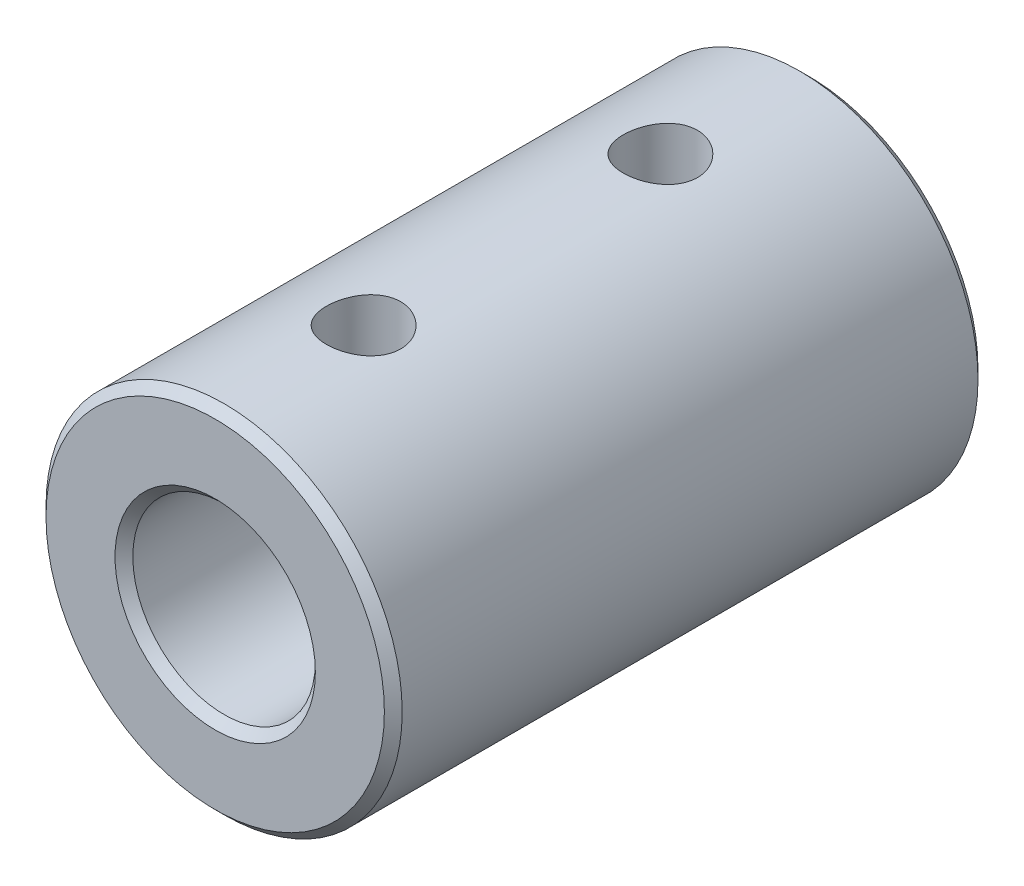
ISO-10303-21;
HEADER;
FILE_DESCRIPTION(('STEP AP214'),'2;1');
FILE_NAME('part.step','',(''),(''),'','','');
FILE_SCHEMA(('AUTOMOTIVE_DESIGN { 1 0 10303 214 1 1 1 1 }'));
ENDSEC;
DATA;
#1=APPLICATION_CONTEXT('core data for automotive mechanical design processes');
#2=APPLICATION_PROTOCOL_DEFINITION('international standard','automotive_design',2000,#1);
#3=PRODUCT_CONTEXT('',#1,'mechanical');
#4=PRODUCT('Part','Part','',(#3));
#5=PRODUCT_RELATED_PRODUCT_CATEGORY('part','',(#4));
#6=PRODUCT_DEFINITION_FORMATION('','',#4);
#7=PRODUCT_DEFINITION_CONTEXT('part definition',#1,'design');
#8=PRODUCT_DEFINITION('design','',#6,#7);
#9=PRODUCT_DEFINITION_SHAPE('','',#8);
#10=(LENGTH_UNIT() NAMED_UNIT(*) SI_UNIT(.MILLI.,.METRE.));
#11=(NAMED_UNIT(*) PLANE_ANGLE_UNIT() SI_UNIT($,.RADIAN.));
#12=(NAMED_UNIT(*) SI_UNIT($,.STERADIAN.) SOLID_ANGLE_UNIT());
#13=UNCERTAINTY_MEASURE_WITH_UNIT(LENGTH_MEASURE(1.E-05),#10,'distance_accuracy_value','');
#14=(GEOMETRIC_REPRESENTATION_CONTEXT(3) GLOBAL_UNCERTAINTY_ASSIGNED_CONTEXT((#13)) GLOBAL_UNIT_ASSIGNED_CONTEXT((#10,
#11,#12)) REPRESENTATION_CONTEXT('',''));
#15=CARTESIAN_POINT('',(0.,0.,0.));
#16=DIRECTION('',(0.,0.,1.));
#17=DIRECTION('',(1.,0.,0.));
#18=AXIS2_PLACEMENT_3D('',#15,#16,#17);
#19=CARTESIAN_POINT('',(0.,0.,10.));
#20=DIRECTION('',(0.,0.,-1.));
#21=DIRECTION('',(-1.,0.,0.));
#22=AXIS2_PLACEMENT_3D('',#19,#20,#21);
#23=CYLINDRICAL_SURFACE('',#22,2.575);
#24=CARTESIAN_POINT('',(0.,0.,-9.7));
#25=DIRECTION('',(0.,0.,1.));
#26=DIRECTION('',(1.,0.,0.));
#27=AXIS2_PLACEMENT_3D('',#24,#25,#26);
#28=CIRCLE('',#27,2.575);
#29=CARTESIAN_POINT('',(2.575,0.,-9.7));
#30=VERTEX_POINT('',#29);
#31=EDGE_CURVE('E45',#30,#30,#28,.F.);
#32=ORIENTED_EDGE('',*,*,#31,.T.);
#33=EDGE_LOOP('',(#32));
#34=FACE_BOUND('',#33,.T.);
#35=CARTESIAN_POINT('',(0.,-2.575,-3.75));
#36=CARTESIAN_POINT('',(0.0659422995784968,-2.57499662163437,-3.75000394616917));
#37=CARTESIAN_POINT('',(0.13196997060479,-2.57243945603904,-3.7552487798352));
#38=CARTESIAN_POINT('',(0.262088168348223,-2.56246251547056,-3.77600290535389));
#39=CARTESIAN_POINT('',(0.326174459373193,-2.55503281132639,-3.79153315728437));
#40=CARTESIAN_POINT('',(0.450326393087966,-2.53609147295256,-3.83211533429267));
#41=CARTESIAN_POINT('',(0.5104063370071,-2.52459539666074,-3.85713099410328));
#42=CARTESIAN_POINT('',(0.625434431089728,-2.49858743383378,-3.91579340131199));
#43=CARTESIAN_POINT('',(0.680383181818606,-2.48407590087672,-3.94943913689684));
#44=CARTESIAN_POINT('',(0.787174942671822,-2.45239885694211,-4.02663226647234));
#45=CARTESIAN_POINT('',(0.838653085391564,-2.43512824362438,-4.07064070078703));
#46=CARTESIAN_POINT('',(0.933830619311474,-2.40024159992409,-4.16632171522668));
#47=CARTESIAN_POINT('',(0.97752444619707,-2.38262533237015,-4.21799972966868));
#48=CARTESIAN_POINT('',(1.05903996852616,-2.34758767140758,-4.33202482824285));
#49=CARTESIAN_POINT('',(1.09621237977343,-2.3302716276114,-4.39487218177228));
#50=CARTESIAN_POINT('',(1.15930253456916,-2.29953964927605,-4.52686417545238));
#51=CARTESIAN_POINT('',(1.18522795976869,-2.28612105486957,-4.59600447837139));
#52=CARTESIAN_POINT('',(1.22346113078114,-2.26588045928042,-4.73449135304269));
#53=CARTESIAN_POINT('',(1.23647410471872,-2.25871975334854,-4.80359133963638));
#54=CARTESIAN_POINT('',(1.25068362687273,-2.250886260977,-4.94333468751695));
#55=CARTESIAN_POINT('',(1.25189069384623,-2.25020769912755,-5.01397661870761));
#56=CARTESIAN_POINT('',(1.24297346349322,-2.255139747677,-5.14637193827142));
#57=CARTESIAN_POINT('',(1.23409320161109,-2.26005999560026,-5.20824088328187));
#58=CARTESIAN_POINT('',(1.20739596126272,-2.27443343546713,-5.32946783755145));
#59=CARTESIAN_POINT('',(1.18957639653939,-2.28388793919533,-5.38882511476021));
#60=CARTESIAN_POINT('',(1.14516820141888,-2.30647890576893,-5.50502602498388));
#61=CARTESIAN_POINT('',(1.11838488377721,-2.31969604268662,-5.56177883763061));
#62=CARTESIAN_POINT('',(1.05695560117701,-2.34832214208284,-5.67024948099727));
#63=CARTESIAN_POINT('',(1.02230613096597,-2.36373208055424,-5.72196505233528));
#64=CARTESIAN_POINT('',(0.941329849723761,-2.39721918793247,-5.82535117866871));
#65=CARTESIAN_POINT('',(0.894105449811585,-2.41539592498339,-5.87628884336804));
#66=CARTESIAN_POINT('',(0.791686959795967,-2.4508761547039,-5.96981623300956));
#67=CARTESIAN_POINT('',(0.736489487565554,-2.46817927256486,-6.01240239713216));
#68=CARTESIAN_POINT('',(0.616777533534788,-2.50084218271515,-6.08966239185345));
#69=CARTESIAN_POINT('',(0.551971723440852,-2.51609171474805,-6.12393515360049));
#70=CARTESIAN_POINT('',(0.416585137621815,-2.54201046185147,-6.18082028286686));
#71=CARTESIAN_POINT('',(0.346008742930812,-2.55268311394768,-6.20344140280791));
#72=CARTESIAN_POINT('',(0.207107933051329,-2.56753123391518,-6.23461037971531));
#73=CARTESIAN_POINT('',(0.139051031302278,-2.57215603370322,-6.24413465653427));
#74=CARTESIAN_POINT('',(0.0021574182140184,-2.57590769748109,-6.25187419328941));
#75=CARTESIAN_POINT('',(-0.0666789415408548,-2.57503694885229,-6.25009436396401));
#76=CARTESIAN_POINT('',(-0.197908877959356,-2.56816400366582,-6.23586959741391));
#77=CARTESIAN_POINT('',(-0.260409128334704,-2.56253632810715,-6.22420290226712));
#78=CARTESIAN_POINT('',(-0.382449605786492,-2.54718310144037,-6.19173017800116));
#79=CARTESIAN_POINT('',(-0.441989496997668,-2.53745708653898,-6.17092311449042));
#80=CARTESIAN_POINT('',(-0.55845274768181,-2.51443547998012,-6.12017245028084));
#81=CARTESIAN_POINT('',(-0.615246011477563,-2.50104251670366,-6.08997602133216));
#82=CARTESIAN_POINT('',(-0.723154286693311,-2.47200329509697,-6.02158374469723));
#83=CARTESIAN_POINT('',(-0.77426681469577,-2.45635605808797,-5.98338441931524));
#84=CARTESIAN_POINT('',(-0.874436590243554,-2.42260893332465,-5.89592728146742));
#85=CARTESIAN_POINT('',(-0.922851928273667,-2.40441663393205,-5.84596847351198));
#86=CARTESIAN_POINT('',(-1.01088220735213,-2.36875550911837,-5.73854163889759));
#87=CARTESIAN_POINT('',(-1.05049191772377,-2.35128711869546,-5.68106918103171));
#88=CARTESIAN_POINT('',(-1.12128952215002,-2.3183882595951,-5.55722533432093));
#89=CARTESIAN_POINT('',(-1.15206481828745,-2.30307092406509,-5.49058544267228));
#90=CARTESIAN_POINT('',(-1.20163612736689,-2.27760498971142,-5.3520840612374));
#91=CARTESIAN_POINT('',(-1.22044665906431,-2.26745012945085,-5.28022901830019));
#92=CARTESIAN_POINT('',(-1.24389470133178,-2.25466477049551,-5.1405678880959));
#93=CARTESIAN_POINT('',(-1.24969648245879,-2.25141765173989,-5.07301452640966));
#94=CARTESIAN_POINT('',(-1.25027988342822,-2.25109477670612,-4.93785622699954));
#95=CARTESIAN_POINT('',(-1.24506544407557,-2.25401681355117,-4.8702513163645));
#96=CARTESIAN_POINT('',(-1.22483639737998,-2.26506358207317,-4.7429461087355));
#97=CARTESIAN_POINT('',(-1.21069255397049,-2.27272493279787,-4.68306239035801));
#98=CARTESIAN_POINT('',(-1.17403866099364,-2.29187330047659,-4.56656634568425));
#99=CARTESIAN_POINT('',(-1.15152602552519,-2.30336149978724,-4.50995503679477));
#100=CARTESIAN_POINT('',(-1.09706896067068,-2.329814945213,-4.3974163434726));
#101=CARTESIAN_POINT('',(-1.06459263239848,-2.34496189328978,-4.34179023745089));
#102=CARTESIAN_POINT('',(-0.991743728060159,-2.37668832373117,-4.23642188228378));
#103=CARTESIAN_POINT('',(-0.951367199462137,-2.39326852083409,-4.18668259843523));
#104=CARTESIAN_POINT('',(-0.858549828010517,-2.42821747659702,-4.08871565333));
#105=CARTESIAN_POINT('',(-0.805264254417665,-2.44657856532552,-4.04128126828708));
#106=CARTESIAN_POINT('',(-0.690935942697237,-2.48128963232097,-3.95587451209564));
#107=CARTESIAN_POINT('',(-0.629889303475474,-2.49763859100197,-3.91790692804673));
#108=CARTESIAN_POINT('',(-0.501380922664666,-2.52657554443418,-3.8526923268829));
#109=CARTESIAN_POINT('',(-0.43391218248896,-2.53915937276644,-3.82545717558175));
#110=CARTESIAN_POINT('',(-0.294656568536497,-2.55904499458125,-3.78306049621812));
#111=CARTESIAN_POINT('',(-0.222882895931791,-2.56636212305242,-3.76786390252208));
#112=CARTESIAN_POINT('',(-0.125366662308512,-2.57206898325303,-3.75604773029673));
#113=CARTESIAN_POINT('',(-0.100363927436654,-2.57316556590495,-3.75378268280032));
#114=CARTESIAN_POINT('',(-0.0502449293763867,-2.57463172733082,-3.75075804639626));
#115=CARTESIAN_POINT('',(-0.0251286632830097,-2.57500128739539,-3.74999849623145));
#116=CARTESIAN_POINT('',(0.,-2.575,-3.75));
#117=B_SPLINE_CURVE_WITH_KNOTS('',3,(#35,#36,#37,#38,#39,#40,#41,#42,#43,#44,#45,#46,#47,#48,
#49,#50,#51,#52,#53,#54,#55,#56,#57,#58,#59,#60,#61,#62,#63,#64,#65,#66,#67,#68,#69,#70,#71,#72,
#73,#74,#75,#76,#77,#78,#79,#80,#81,#82,#83,#84,#85,#86,#87,#88,#89,#90,#91,#92,#93,#94,#95,#96,
#97,#98,#99,#100,#101,#102,#103,#104,#105,#106,#107,#108,#109,#110,#111,#112,#113,#114,#115,
#116),.UNSPECIFIED.,.T.,.F.,(4,2,2,2,2,2,2,2,2,2,2,2,2,2,2,2,2,2,2,2,2,2,2,2,2,2,2,2,2,2,2,2,2,
2,2,2,2,2,2,2,4),(0.,0.197724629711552,0.395853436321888,0.593232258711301,0.790587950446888,
0.999387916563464,1.20833654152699,1.43232915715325,1.65616854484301,1.86697002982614,
2.07758367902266,2.26479777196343,2.45206605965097,2.64369869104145,2.83541688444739,
3.04987475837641,3.26442387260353,3.48786483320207,3.71113770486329,3.91664830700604,
4.12206963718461,4.31267942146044,4.5033107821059,4.69959971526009,4.89597412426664,
5.11075856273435,5.32567024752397,5.54940655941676,5.77287085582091,5.97536696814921,
6.17779065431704,6.3630069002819,6.54828042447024,6.74599697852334,6.94381270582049,
7.16378449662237,7.38386729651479,7.6041927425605,7.82387404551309,7.89921912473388,
7.97456614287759),.UNSPECIFIED.);
#118=CARTESIAN_POINT('',(0.,-2.575,-3.75));
#119=VERTEX_POINT('',#118);
#120=EDGE_CURVE('E97',#119,#119,#117,.T.);
#121=ORIENTED_EDGE('',*,*,#120,.F.);
#122=EDGE_LOOP('',(#121));
#123=FACE_BOUND('',#122,.T.);
#124=CARTESIAN_POINT('',(0.,2.575,-3.75));
#125=CARTESIAN_POINT('',(-0.0659422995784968,2.57499662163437,-3.75000394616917));
#126=CARTESIAN_POINT('',(-0.13196997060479,2.57243945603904,-3.7552487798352));
#127=CARTESIAN_POINT('',(-0.262088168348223,2.56246251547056,-3.77600290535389));
#128=CARTESIAN_POINT('',(-0.326174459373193,2.55503281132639,-3.79153315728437));
#129=CARTESIAN_POINT('',(-0.450326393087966,2.53609147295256,-3.83211533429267));
#130=CARTESIAN_POINT('',(-0.5104063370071,2.52459539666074,-3.85713099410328));
#131=CARTESIAN_POINT('',(-0.625434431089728,2.49858743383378,-3.91579340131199));
#132=CARTESIAN_POINT('',(-0.680383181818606,2.48407590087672,-3.94943913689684));
#133=CARTESIAN_POINT('',(-0.787174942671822,2.45239885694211,-4.02663226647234));
#134=CARTESIAN_POINT('',(-0.838653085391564,2.43512824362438,-4.07064070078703));
#135=CARTESIAN_POINT('',(-0.933830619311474,2.40024159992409,-4.16632171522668));
#136=CARTESIAN_POINT('',(-0.97752444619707,2.38262533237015,-4.21799972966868));
#137=CARTESIAN_POINT('',(-1.05903996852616,2.34758767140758,-4.33202482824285));
#138=CARTESIAN_POINT('',(-1.09621237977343,2.3302716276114,-4.39487218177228));
#139=CARTESIAN_POINT('',(-1.15930253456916,2.29953964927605,-4.52686417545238));
#140=CARTESIAN_POINT('',(-1.18522795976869,2.28612105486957,-4.59600447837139));
#141=CARTESIAN_POINT('',(-1.22346113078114,2.26588045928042,-4.73449135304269));
#142=CARTESIAN_POINT('',(-1.23647410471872,2.25871975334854,-4.80359133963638));
#143=CARTESIAN_POINT('',(-1.25068362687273,2.250886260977,-4.94333468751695));
#144=CARTESIAN_POINT('',(-1.25189069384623,2.25020769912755,-5.01397661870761));
#145=CARTESIAN_POINT('',(-1.24297346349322,2.255139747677,-5.14637193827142));
#146=CARTESIAN_POINT('',(-1.23409320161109,2.26005999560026,-5.20824088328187));
#147=CARTESIAN_POINT('',(-1.20739596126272,2.27443343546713,-5.32946783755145));
#148=CARTESIAN_POINT('',(-1.18957639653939,2.28388793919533,-5.38882511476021));
#149=CARTESIAN_POINT('',(-1.14516820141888,2.30647890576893,-5.50502602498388));
#150=CARTESIAN_POINT('',(-1.11838488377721,2.31969604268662,-5.56177883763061));
#151=CARTESIAN_POINT('',(-1.05695560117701,2.34832214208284,-5.67024948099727));
#152=CARTESIAN_POINT('',(-1.02230613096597,2.36373208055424,-5.72196505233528));
#153=CARTESIAN_POINT('',(-0.941329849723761,2.39721918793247,-5.82535117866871));
#154=CARTESIAN_POINT('',(-0.894105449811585,2.41539592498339,-5.87628884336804));
#155=CARTESIAN_POINT('',(-0.791686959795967,2.4508761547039,-5.96981623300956));
#156=CARTESIAN_POINT('',(-0.736489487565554,2.46817927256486,-6.01240239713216));
#157=CARTESIAN_POINT('',(-0.616777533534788,2.50084218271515,-6.08966239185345));
#158=CARTESIAN_POINT('',(-0.551971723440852,2.51609171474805,-6.12393515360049));
#159=CARTESIAN_POINT('',(-0.416585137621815,2.54201046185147,-6.18082028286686));
#160=CARTESIAN_POINT('',(-0.346008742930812,2.55268311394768,-6.20344140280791));
#161=CARTESIAN_POINT('',(-0.207107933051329,2.56753123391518,-6.23461037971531));
#162=CARTESIAN_POINT('',(-0.139051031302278,2.57215603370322,-6.24413465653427));
#163=CARTESIAN_POINT('',(-0.0021574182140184,2.57590769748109,-6.25187419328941));
#164=CARTESIAN_POINT('',(0.0666789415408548,2.57503694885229,-6.25009436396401));
#165=CARTESIAN_POINT('',(0.197908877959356,2.56816400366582,-6.23586959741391));
#166=CARTESIAN_POINT('',(0.260409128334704,2.56253632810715,-6.22420290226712));
#167=CARTESIAN_POINT('',(0.382449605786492,2.54718310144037,-6.19173017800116));
#168=CARTESIAN_POINT('',(0.441989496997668,2.53745708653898,-6.17092311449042));
#169=CARTESIAN_POINT('',(0.55845274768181,2.51443547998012,-6.12017245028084));
#170=CARTESIAN_POINT('',(0.615246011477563,2.50104251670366,-6.08997602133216));
#171=CARTESIAN_POINT('',(0.723154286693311,2.47200329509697,-6.02158374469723));
#172=CARTESIAN_POINT('',(0.77426681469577,2.45635605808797,-5.98338441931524));
#173=CARTESIAN_POINT('',(0.874436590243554,2.42260893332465,-5.89592728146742));
#174=CARTESIAN_POINT('',(0.922851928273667,2.40441663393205,-5.84596847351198));
#175=CARTESIAN_POINT('',(1.01088220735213,2.36875550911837,-5.73854163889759));
#176=CARTESIAN_POINT('',(1.05049191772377,2.35128711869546,-5.68106918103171));
#177=CARTESIAN_POINT('',(1.12128952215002,2.3183882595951,-5.55722533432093));
#178=CARTESIAN_POINT('',(1.15206481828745,2.30307092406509,-5.49058544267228));
#179=CARTESIAN_POINT('',(1.20163612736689,2.27760498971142,-5.3520840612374));
#180=CARTESIAN_POINT('',(1.22044665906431,2.26745012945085,-5.28022901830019));
#181=CARTESIAN_POINT('',(1.24389470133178,2.25466477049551,-5.1405678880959));
#182=CARTESIAN_POINT('',(1.24969648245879,2.25141765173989,-5.07301452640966));
#183=CARTESIAN_POINT('',(1.25027988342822,2.25109477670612,-4.93785622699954));
#184=CARTESIAN_POINT('',(1.24506544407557,2.25401681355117,-4.8702513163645));
#185=CARTESIAN_POINT('',(1.22483639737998,2.26506358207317,-4.7429461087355));
#186=CARTESIAN_POINT('',(1.21069255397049,2.27272493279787,-4.68306239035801));
#187=CARTESIAN_POINT('',(1.17403866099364,2.29187330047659,-4.56656634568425));
#188=CARTESIAN_POINT('',(1.15152602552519,2.30336149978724,-4.50995503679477));
#189=CARTESIAN_POINT('',(1.09706896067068,2.329814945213,-4.3974163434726));
#190=CARTESIAN_POINT('',(1.06459263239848,2.34496189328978,-4.34179023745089));
#191=CARTESIAN_POINT('',(0.991743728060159,2.37668832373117,-4.23642188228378));
#192=CARTESIAN_POINT('',(0.951367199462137,2.39326852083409,-4.18668259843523));
#193=CARTESIAN_POINT('',(0.858549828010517,2.42821747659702,-4.08871565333));
#194=CARTESIAN_POINT('',(0.805264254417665,2.44657856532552,-4.04128126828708));
#195=CARTESIAN_POINT('',(0.690935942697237,2.48128963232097,-3.95587451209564));
#196=CARTESIAN_POINT('',(0.629889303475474,2.49763859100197,-3.91790692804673));
#197=CARTESIAN_POINT('',(0.501380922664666,2.52657554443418,-3.8526923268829));
#198=CARTESIAN_POINT('',(0.43391218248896,2.53915937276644,-3.82545717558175));
#199=CARTESIAN_POINT('',(0.294656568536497,2.55904499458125,-3.78306049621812));
#200=CARTESIAN_POINT('',(0.222882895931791,2.56636212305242,-3.76786390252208));
#201=CARTESIAN_POINT('',(0.125366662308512,2.57206898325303,-3.75604773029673));
#202=CARTESIAN_POINT('',(0.100363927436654,2.57316556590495,-3.75378268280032));
#203=CARTESIAN_POINT('',(0.0502449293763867,2.57463172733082,-3.75075804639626));
#204=CARTESIAN_POINT('',(0.0251286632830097,2.57500128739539,-3.74999849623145));
#205=CARTESIAN_POINT('',(0.,2.575,-3.75));
#206=B_SPLINE_CURVE_WITH_KNOTS('',3,(#124,#125,#126,#127,#128,#129,#130,#131,#132,#133,#134,
#135,#136,#137,#138,#139,#140,#141,#142,#143,#144,#145,#146,#147,#148,#149,#150,#151,#152,#153,
#154,#155,#156,#157,#158,#159,#160,#161,#162,#163,#164,#165,#166,#167,#168,#169,#170,#171,#172,
#173,#174,#175,#176,#177,#178,#179,#180,#181,#182,#183,#184,#185,#186,#187,#188,#189,#190,#191,
#192,#193,#194,#195,#196,#197,#198,#199,#200,#201,#202,#203,#204,#205),.UNSPECIFIED.,.T.,.F.,(4,
2,2,2,2,2,2,2,2,2,2,2,2,2,2,2,2,2,2,2,2,2,2,2,2,2,2,2,2,2,2,2,2,2,2,2,2,2,2,2,4),(0.,
0.197724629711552,0.395853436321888,0.593232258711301,0.790587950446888,0.999387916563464,
1.20833654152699,1.43232915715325,1.65616854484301,1.86697002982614,2.07758367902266,
2.26479777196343,2.45206605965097,2.64369869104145,2.83541688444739,3.04987475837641,
3.26442387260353,3.48786483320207,3.71113770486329,3.91664830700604,4.12206963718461,
4.31267942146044,4.5033107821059,4.69959971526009,4.89597412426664,5.11075856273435,
5.32567024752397,5.54940655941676,5.77287085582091,5.97536696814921,6.17779065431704,
6.3630069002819,6.54828042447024,6.74599697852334,6.94381270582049,7.16378449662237,
7.38386729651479,7.6041927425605,7.82387404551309,7.89921912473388,7.97456614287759),.UNSPECIFIED.);
#207=CARTESIAN_POINT('',(0.,2.575,-3.75));
#208=VERTEX_POINT('',#207);
#209=EDGE_CURVE('E92',#208,#208,#206,.T.);
#210=ORIENTED_EDGE('',*,*,#209,.F.);
#211=EDGE_LOOP('',(#210));
#212=FACE_BOUND('',#211,.T.);
#213=CARTESIAN_POINT('',(0.,0.,0.));
#214=DIRECTION('',(0.,0.,1.));
#215=DIRECTION('',(1.,0.,0.));
#216=AXIS2_PLACEMENT_3D('',#213,#214,#215);
#217=CIRCLE('',#216,2.575);
#218=CARTESIAN_POINT('',(2.575,0.,0.));
#219=VERTEX_POINT('',#218);
#220=EDGE_CURVE('E142',#219,#219,#217,.T.);
#221=ORIENTED_EDGE('',*,*,#220,.T.);
#222=EDGE_LOOP('',(#221));
#223=FACE_BOUND('',#222,.T.);
#224=ADVANCED_FACE('F30',(#34,#123,#212,#223),#23,.F.);
#225=CARTESIAN_POINT('',(0.,0.,10.));
#226=DIRECTION('',(0.,0.,1.));
#227=DIRECTION('',(1.,0.,0.));
#228=AXIS2_PLACEMENT_3D('',#225,#226,#227);
#229=PLANE('',#228);
#230=CARTESIAN_POINT('',(0.,0.,10.));
#231=DIRECTION('',(0.,0.,1.));
#232=DIRECTION('',(1.,0.,0.));
#233=AXIS2_PLACEMENT_3D('',#230,#231,#232);
#234=CIRCLE('',#233,3.37500000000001);
#235=CARTESIAN_POINT('',(3.37500000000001,0.,10.));
#236=VERTEX_POINT('',#235);
#237=EDGE_CURVE('E10',#236,#236,#234,.F.);
#238=ORIENTED_EDGE('',*,*,#237,.T.);
#239=EDGE_LOOP('',(#238));
#240=FACE_BOUND('',#239,.T.);
#241=CARTESIAN_POINT('',(0.,0.,10.));
#242=DIRECTION('',(0.,0.,1.));
#243=DIRECTION('',(1.,0.,0.));
#244=AXIS2_PLACEMENT_3D('',#241,#242,#243);
#245=CIRCLE('',#244,5.7);
#246=CARTESIAN_POINT('',(-5.7,0.,10.));
#247=VERTEX_POINT('',#246);
#248=EDGE_CURVE('E37',#247,#247,#245,.T.);
#249=ORIENTED_EDGE('',*,*,#248,.T.);
#250=EDGE_LOOP('',(#249));
#251=FACE_BOUND('',#250,.T.);
#252=ADVANCED_FACE('F105',(#240,#251),#229,.T.);
#253=CARTESIAN_POINT('',(0.,0.,-10.));
#254=DIRECTION('',(0.,0.,1.));
#255=DIRECTION('',(1.,0.,0.));
#256=AXIS2_PLACEMENT_3D('',#253,#254,#255);
#257=PLANE('',#256);
#258=CARTESIAN_POINT('',(0.,0.,-10.));
#259=DIRECTION('',(0.,0.,1.));
#260=DIRECTION('',(1.,0.,0.));
#261=AXIS2_PLACEMENT_3D('',#258,#259,#260);
#262=CIRCLE('',#261,5.7);
#263=CARTESIAN_POINT('',(5.7,0.,-10.));
#264=VERTEX_POINT('',#263);
#265=EDGE_CURVE('E50',#264,#264,#262,.F.);
#266=ORIENTED_EDGE('',*,*,#265,.T.);
#267=EDGE_LOOP('',(#266));
#268=FACE_BOUND('',#267,.T.);
#269=CARTESIAN_POINT('',(0.,0.,-10.));
#270=DIRECTION('',(0.,0.,1.));
#271=DIRECTION('',(1.,0.,0.));
#272=AXIS2_PLACEMENT_3D('',#269,#270,#271);
#273=CIRCLE('',#272,2.875);
#274=CARTESIAN_POINT('',(2.875,0.,-10.));
#275=VERTEX_POINT('',#274);
#276=EDGE_CURVE('E53',#275,#275,#273,.T.);
#277=ORIENTED_EDGE('',*,*,#276,.T.);
#278=EDGE_LOOP('',(#277));
#279=FACE_BOUND('',#278,.T.);
#280=ADVANCED_FACE('F111',(#268,#279),#257,.F.);
#281=CARTESIAN_POINT('',(0.,0.,10.));
#282=DIRECTION('',(0.,0.,-1.));
#283=DIRECTION('',(-1.,0.,0.));
#284=AXIS2_PLACEMENT_3D('',#281,#282,#283);
#285=CYLINDRICAL_SURFACE('',#284,6.);
#286=CARTESIAN_POINT('',(0.,0.,-9.7));
#287=DIRECTION('',(0.,0.,1.));
#288=DIRECTION('',(1.,0.,0.));
#289=AXIS2_PLACEMENT_3D('',#286,#287,#288);
#290=CIRCLE('',#289,6.);
#291=CARTESIAN_POINT('',(6.,0.,-9.7));
#292=VERTEX_POINT('',#291);
#293=EDGE_CURVE('E56',#292,#292,#290,.T.);
#294=ORIENTED_EDGE('',*,*,#293,.T.);
#295=EDGE_LOOP('',(#294));
#296=FACE_BOUND('',#295,.T.);
#297=CARTESIAN_POINT('',(0.,0.,9.7));
#298=DIRECTION('',(0.,0.,1.));
#299=DIRECTION('',(1.,0.,0.));
#300=AXIS2_PLACEMENT_3D('',#297,#298,#299);
#301=CIRCLE('',#300,6.);
#302=CARTESIAN_POINT('',(-6.,0.,9.7));
#303=VERTEX_POINT('',#302);
#304=EDGE_CURVE('E59',#303,#303,#301,.F.);
#305=ORIENTED_EDGE('',*,*,#304,.T.);
#306=EDGE_LOOP('',(#305));
#307=FACE_BOUND('',#306,.T.);
#308=CARTESIAN_POINT('',(0.,-6.,-3.75));
#309=CARTESIAN_POINT('',(0.0694090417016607,-5.99999871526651,-3.75000247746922));
#310=CARTESIAN_POINT('',(0.138848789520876,-5.99878328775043,-3.75580066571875));
#311=CARTESIAN_POINT('',(0.275761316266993,-5.9940520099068,-3.77881934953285));
#312=CARTESIAN_POINT('',(0.343232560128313,-5.99053441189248,-3.79604852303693));
#313=CARTESIAN_POINT('',(0.474209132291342,-5.98159109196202,-3.84137045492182));
#314=CARTESIAN_POINT('',(0.537718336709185,-5.97616727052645,-3.86945239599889));
#315=CARTESIAN_POINT('',(0.659120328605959,-5.96399927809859,-3.93564960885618));
#316=CARTESIAN_POINT('',(0.717013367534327,-5.95725516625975,-3.97376443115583));
#317=CARTESIAN_POINT('',(0.826390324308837,-5.9430770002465,-4.05953634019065));
#318=CARTESIAN_POINT('',(0.877780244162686,-5.93563505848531,-4.10731200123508));
#319=CARTESIAN_POINT('',(0.971877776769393,-5.92095657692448,-4.21079465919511));
#320=CARTESIAN_POINT('',(1.01458467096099,-5.91372005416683,-4.26650231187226));
#321=CARTESIAN_POINT('',(1.09051031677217,-5.90019442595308,-4.38495196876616));
#322=CARTESIAN_POINT('',(1.12363054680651,-5.89391545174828,-4.44775838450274));
#323=CARTESIAN_POINT('',(1.17881119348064,-5.8831284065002,-4.57819745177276));
#324=CARTESIAN_POINT('',(1.20087280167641,-5.87862014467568,-4.64582958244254));
#325=CARTESIAN_POINT('',(1.23300240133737,-5.87196500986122,-4.78298523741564));
#326=CARTESIAN_POINT('',(1.24323597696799,-5.86978556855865,-4.85246835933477));
#327=CARTESIAN_POINT('',(1.25193357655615,-5.86793690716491,-4.99219684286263));
#328=CARTESIAN_POINT('',(1.25039890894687,-5.86826740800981,-5.0624421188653));
#329=CARTESIAN_POINT('',(1.23573719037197,-5.87137174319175,-5.20048102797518));
#330=CARTESIAN_POINT('',(1.2228010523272,-5.87410533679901,-5.26829597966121));
#331=CARTESIAN_POINT('',(1.18600543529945,-5.88164437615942,-5.40077150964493));
#332=CARTESIAN_POINT('',(1.16214539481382,-5.88644992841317,-5.46543192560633));
#333=CARTESIAN_POINT('',(1.10400003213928,-5.89763191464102,-5.59030722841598));
#334=CARTESIAN_POINT('',(1.06964002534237,-5.90401953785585,-5.65048629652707));
#335=CARTESIAN_POINT('',(0.991522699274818,-5.91763890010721,-5.76429574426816));
#336=CARTESIAN_POINT('',(0.947764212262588,-5.92487074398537,-5.81792530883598));
#337=CARTESIAN_POINT('',(0.851074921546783,-5.93953730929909,-5.91821396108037));
#338=CARTESIAN_POINT('',(0.797981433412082,-5.94697323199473,-5.96471616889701));
#339=CARTESIAN_POINT('',(0.684667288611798,-5.96108088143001,-6.04818044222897));
#340=CARTESIAN_POINT('',(0.624446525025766,-5.96775259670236,-6.0851423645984));
#341=CARTESIAN_POINT('',(0.498405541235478,-5.97959870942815,-6.14851008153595));
#342=CARTESIAN_POINT('',(0.4325754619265,-5.98477039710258,-6.17489680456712));
#343=CARTESIAN_POINT('',(0.297284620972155,-5.99301338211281,-6.21619170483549));
#344=CARTESIAN_POINT('',(0.227824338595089,-5.99608495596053,-6.2311013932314));
#345=CARTESIAN_POINT('',(0.0885918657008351,-5.99974275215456,-6.24879425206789));
#346=CARTESIAN_POINT('',(0.0188480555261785,-6.00037293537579,-6.25179194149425));
#347=CARTESIAN_POINT('',(-0.120143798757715,-5.99919952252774,-6.2461550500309));
#348=CARTESIAN_POINT('',(-0.189391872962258,-5.99739607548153,-6.2375211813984));
#349=CARTESIAN_POINT('',(-0.324726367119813,-5.99158564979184,-6.20904434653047));
#350=CARTESIAN_POINT('',(-0.390837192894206,-5.98760052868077,-6.18931251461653));
#351=CARTESIAN_POINT('',(-0.518811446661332,-5.97787227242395,-6.13932213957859));
#352=CARTESIAN_POINT('',(-0.580674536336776,-5.97212899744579,-6.10906275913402));
#353=CARTESIAN_POINT('',(-0.699294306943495,-5.95941241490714,-6.03841962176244));
#354=CARTESIAN_POINT('',(-0.755973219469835,-5.9524239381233,-5.99790807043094));
#355=CARTESIAN_POINT('',(-0.861805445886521,-5.93802568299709,-5.90808043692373));
#356=CARTESIAN_POINT('',(-0.910957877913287,-5.93061585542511,-5.85876332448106));
#357=CARTESIAN_POINT('',(-1.0011786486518,-5.91606024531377,-5.7517444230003));
#358=CARTESIAN_POINT('',(-1.04209914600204,-5.90892089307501,-5.69391696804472));
#359=CARTESIAN_POINT('',(-1.11364719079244,-5.89585601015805,-5.57208371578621));
#360=CARTESIAN_POINT('',(-1.14427516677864,-5.88993042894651,-5.50807817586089));
#361=CARTESIAN_POINT('',(-1.19417246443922,-5.88001700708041,-5.37603880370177));
#362=CARTESIAN_POINT('',(-1.21350309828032,-5.87601872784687,-5.30802896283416));
#363=CARTESIAN_POINT('',(-1.24044038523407,-5.87039184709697,-5.16963344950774));
#364=CARTESIAN_POINT('',(-1.24804871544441,-5.86876290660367,-5.09924811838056));
#365=CARTESIAN_POINT('',(-1.25125926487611,-5.86807907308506,-4.95958659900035));
#366=CARTESIAN_POINT('',(-1.24709542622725,-5.86897402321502,-4.89031592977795));
#367=CARTESIAN_POINT('',(-1.22739905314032,-5.87312447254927,-4.75348599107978));
#368=CARTESIAN_POINT('',(-1.21186662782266,-5.87637994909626,-4.68592670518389));
#369=CARTESIAN_POINT('',(-1.16998217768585,-5.88486132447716,-4.55460222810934));
#370=CARTESIAN_POINT('',(-1.14366117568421,-5.8900815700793,-4.49082675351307));
#371=CARTESIAN_POINT('',(-1.08097457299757,-5.90190705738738,-4.36856122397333));
#372=CARTESIAN_POINT('',(-1.0446080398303,-5.9085124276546,-4.31007166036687));
#373=CARTESIAN_POINT('',(-0.962073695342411,-5.92251579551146,-4.19887837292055));
#374=CARTESIAN_POINT('',(-0.915737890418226,-5.92992613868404,-4.14630087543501));
#375=CARTESIAN_POINT('',(-0.814924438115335,-5.94461839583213,-4.04959050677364));
#376=CARTESIAN_POINT('',(-0.760444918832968,-5.9519002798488,-4.00545958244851));
#377=CARTESIAN_POINT('',(-0.644134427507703,-5.96561444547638,-3.92641142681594));
#378=CARTESIAN_POINT('',(-0.582225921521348,-5.97203596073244,-3.89160632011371));
#379=CARTESIAN_POINT('',(-0.453319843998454,-5.98319908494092,-3.83294977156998));
#380=CARTESIAN_POINT('',(-0.386326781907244,-5.98794216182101,-3.80908875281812));
#381=CARTESIAN_POINT('',(-0.266015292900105,-5.99432499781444,-3.77745972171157));
#382=CARTESIAN_POINT('',(-0.213367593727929,-5.99644035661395,-3.76718123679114));
#383=CARTESIAN_POINT('',(-0.107152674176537,-5.99927832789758,-3.75345054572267));
#384=CARTESIAN_POINT('',(-0.0535854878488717,-6.00000099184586,-3.74999808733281));
#385=CARTESIAN_POINT('',(0.,-6.,-3.75));
#386=B_SPLINE_CURVE_WITH_KNOTS('',3,(#308,#309,#310,#311,#312,#313,#314,#315,#316,#317,#318,
#319,#320,#321,#322,#323,#324,#325,#326,#327,#328,#329,#330,#331,#332,#333,#334,#335,#336,#337,
#338,#339,#340,#341,#342,#343,#344,#345,#346,#347,#348,#349,#350,#351,#352,#353,#354,#355,#356,
#357,#358,#359,#360,#361,#362,#363,#364,#365,#366,#367,#368,#369,#370,#371,#372,#373,#374,#375,
#376,#377,#378,#379,#380,#381,#382,#383,#384,#385),.UNSPECIFIED.,.T.,.F.,(4,2,2,2,2,2,2,2,2,2,2,
2,2,2,2,2,2,2,2,2,2,2,2,2,2,2,2,2,2,2,2,2,2,2,2,2,2,2,4),(0.,0.208031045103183,
0.416220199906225,0.624202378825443,0.83217524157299,1.04287526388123,1.25359271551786,
1.46640449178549,1.6791933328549,1.88896575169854,2.09871484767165,2.3050171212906,
2.5113300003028,2.71914592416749,2.92698768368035,3.13889526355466,3.35080602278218,
3.56309724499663,3.77536051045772,3.98378339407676,4.19219351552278,4.39855286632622,
4.60492863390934,4.81401583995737,5.02312752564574,5.23571263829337,5.4482888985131,
5.65970050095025,5.87108185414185,6.07829223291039,6.28550062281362,6.49211731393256,
6.6987531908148,6.9091902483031,7.1196757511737,7.33258864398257,7.54531486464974,
7.70592588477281,7.86653096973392),.UNSPECIFIED.);
#387=CARTESIAN_POINT('',(0.,-6.,-3.75));
#388=VERTEX_POINT('',#387);
#389=EDGE_CURVE('E62',#388,#388,#386,.T.);
#390=ORIENTED_EDGE('',*,*,#389,.T.);
#391=EDGE_LOOP('',(#390));
#392=FACE_BOUND('',#391,.T.);
#393=CARTESIAN_POINT('',(0.,6.,-3.75));
#394=CARTESIAN_POINT('',(-0.0694090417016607,5.99999871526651,-3.75000247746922));
#395=CARTESIAN_POINT('',(-0.138848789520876,5.99878328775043,-3.75580066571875));
#396=CARTESIAN_POINT('',(-0.275761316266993,5.9940520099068,-3.77881934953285));
#397=CARTESIAN_POINT('',(-0.343232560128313,5.99053441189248,-3.79604852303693));
#398=CARTESIAN_POINT('',(-0.474209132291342,5.98159109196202,-3.84137045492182));
#399=CARTESIAN_POINT('',(-0.537718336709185,5.97616727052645,-3.86945239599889));
#400=CARTESIAN_POINT('',(-0.659120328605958,5.96399927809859,-3.93564960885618));
#401=CARTESIAN_POINT('',(-0.717013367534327,5.95725516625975,-3.97376443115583));
#402=CARTESIAN_POINT('',(-0.826390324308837,5.9430770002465,-4.05953634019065));
#403=CARTESIAN_POINT('',(-0.877780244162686,5.93563505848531,-4.10731200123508));
#404=CARTESIAN_POINT('',(-0.971877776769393,5.92095657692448,-4.21079465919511));
#405=CARTESIAN_POINT('',(-1.01458467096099,5.91372005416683,-4.26650231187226));
#406=CARTESIAN_POINT('',(-1.09051031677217,5.90019442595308,-4.38495196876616));
#407=CARTESIAN_POINT('',(-1.12363054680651,5.89391545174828,-4.44775838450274));
#408=CARTESIAN_POINT('',(-1.17881119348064,5.8831284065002,-4.57819745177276));
#409=CARTESIAN_POINT('',(-1.20087280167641,5.87862014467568,-4.64582958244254));
#410=CARTESIAN_POINT('',(-1.23300240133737,5.87196500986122,-4.78298523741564));
#411=CARTESIAN_POINT('',(-1.24323597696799,5.86978556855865,-4.85246835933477));
#412=CARTESIAN_POINT('',(-1.25193357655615,5.86793690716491,-4.99219684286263));
#413=CARTESIAN_POINT('',(-1.25039890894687,5.86826740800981,-5.0624421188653));
#414=CARTESIAN_POINT('',(-1.23573719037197,5.87137174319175,-5.20048102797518));
#415=CARTESIAN_POINT('',(-1.2228010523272,5.87410533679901,-5.26829597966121));
#416=CARTESIAN_POINT('',(-1.18600543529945,5.88164437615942,-5.40077150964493));
#417=CARTESIAN_POINT('',(-1.16214539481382,5.88644992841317,-5.46543192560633));
#418=CARTESIAN_POINT('',(-1.10400003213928,5.89763191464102,-5.59030722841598));
#419=CARTESIAN_POINT('',(-1.06964002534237,5.90401953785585,-5.65048629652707));
#420=CARTESIAN_POINT('',(-0.991522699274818,5.91763890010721,-5.76429574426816));
#421=CARTESIAN_POINT('',(-0.947764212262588,5.92487074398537,-5.81792530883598));
#422=CARTESIAN_POINT('',(-0.851074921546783,5.93953730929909,-5.91821396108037));
#423=CARTESIAN_POINT('',(-0.797981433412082,5.94697323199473,-5.96471616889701));
#424=CARTESIAN_POINT('',(-0.684667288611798,5.96108088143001,-6.04818044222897));
#425=CARTESIAN_POINT('',(-0.624446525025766,5.96775259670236,-6.0851423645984));
#426=CARTESIAN_POINT('',(-0.498405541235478,5.97959870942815,-6.14851008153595));
#427=CARTESIAN_POINT('',(-0.4325754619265,5.98477039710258,-6.17489680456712));
#428=CARTESIAN_POINT('',(-0.297284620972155,5.99301338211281,-6.21619170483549));
#429=CARTESIAN_POINT('',(-0.227824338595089,5.99608495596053,-6.2311013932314));
#430=CARTESIAN_POINT('',(-0.0885918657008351,5.99974275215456,-6.24879425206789));
#431=CARTESIAN_POINT('',(-0.0188480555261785,6.00037293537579,-6.25179194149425));
#432=CARTESIAN_POINT('',(0.120143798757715,5.99919952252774,-6.2461550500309));
#433=CARTESIAN_POINT('',(0.189391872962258,5.99739607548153,-6.2375211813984));
#434=CARTESIAN_POINT('',(0.324726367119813,5.99158564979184,-6.20904434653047));
#435=CARTESIAN_POINT('',(0.390837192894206,5.98760052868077,-6.18931251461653));
#436=CARTESIAN_POINT('',(0.518811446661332,5.97787227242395,-6.13932213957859));
#437=CARTESIAN_POINT('',(0.580674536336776,5.97212899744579,-6.10906275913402));
#438=CARTESIAN_POINT('',(0.699294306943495,5.95941241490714,-6.03841962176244));
#439=CARTESIAN_POINT('',(0.755973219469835,5.9524239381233,-5.99790807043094));
#440=CARTESIAN_POINT('',(0.861805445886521,5.93802568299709,-5.90808043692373));
#441=CARTESIAN_POINT('',(0.910957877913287,5.93061585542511,-5.85876332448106));
#442=CARTESIAN_POINT('',(1.0011786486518,5.91606024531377,-5.7517444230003));
#443=CARTESIAN_POINT('',(1.04209914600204,5.90892089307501,-5.69391696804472));
#444=CARTESIAN_POINT('',(1.11364719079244,5.89585601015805,-5.57208371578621));
#445=CARTESIAN_POINT('',(1.14427516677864,5.88993042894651,-5.50807817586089));
#446=CARTESIAN_POINT('',(1.19417246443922,5.88001700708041,-5.37603880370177));
#447=CARTESIAN_POINT('',(1.21350309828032,5.87601872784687,-5.30802896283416));
#448=CARTESIAN_POINT('',(1.24044038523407,5.87039184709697,-5.16963344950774));
#449=CARTESIAN_POINT('',(1.24804871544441,5.86876290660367,-5.09924811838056));
#450=CARTESIAN_POINT('',(1.25125926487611,5.86807907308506,-4.95958659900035));
#451=CARTESIAN_POINT('',(1.24709542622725,5.86897402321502,-4.89031592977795));
#452=CARTESIAN_POINT('',(1.22739905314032,5.87312447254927,-4.75348599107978));
#453=CARTESIAN_POINT('',(1.21186662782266,5.87637994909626,-4.68592670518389));
#454=CARTESIAN_POINT('',(1.16998217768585,5.88486132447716,-4.55460222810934));
#455=CARTESIAN_POINT('',(1.14366117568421,5.8900815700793,-4.49082675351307));
#456=CARTESIAN_POINT('',(1.08097457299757,5.90190705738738,-4.36856122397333));
#457=CARTESIAN_POINT('',(1.0446080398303,5.9085124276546,-4.31007166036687));
#458=CARTESIAN_POINT('',(0.962073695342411,5.92251579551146,-4.19887837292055));
#459=CARTESIAN_POINT('',(0.915737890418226,5.92992613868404,-4.14630087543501));
#460=CARTESIAN_POINT('',(0.814924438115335,5.94461839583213,-4.04959050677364));
#461=CARTESIAN_POINT('',(0.760444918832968,5.9519002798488,-4.00545958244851));
#462=CARTESIAN_POINT('',(0.644134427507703,5.96561444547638,-3.92641142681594));
#463=CARTESIAN_POINT('',(0.582225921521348,5.97203596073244,-3.89160632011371));
#464=CARTESIAN_POINT('',(0.453319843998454,5.98319908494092,-3.83294977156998));
#465=CARTESIAN_POINT('',(0.386326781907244,5.98794216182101,-3.80908875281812));
#466=CARTESIAN_POINT('',(0.266015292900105,5.99432499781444,-3.77745972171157));
#467=CARTESIAN_POINT('',(0.213367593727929,5.99644035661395,-3.76718123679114));
#468=CARTESIAN_POINT('',(0.107152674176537,5.99927832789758,-3.75345054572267));
#469=CARTESIAN_POINT('',(0.0535854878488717,6.00000099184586,-3.74999808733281));
#470=CARTESIAN_POINT('',(0.,6.,-3.75));
#471=B_SPLINE_CURVE_WITH_KNOTS('',3,(#393,#394,#395,#396,#397,#398,#399,#400,#401,#402,#403,
#404,#405,#406,#407,#408,#409,#410,#411,#412,#413,#414,#415,#416,#417,#418,#419,#420,#421,#422,
#423,#424,#425,#426,#427,#428,#429,#430,#431,#432,#433,#434,#435,#436,#437,#438,#439,#440,#441,
#442,#443,#444,#445,#446,#447,#448,#449,#450,#451,#452,#453,#454,#455,#456,#457,#458,#459,#460,
#461,#462,#463,#464,#465,#466,#467,#468,#469,#470),.UNSPECIFIED.,.T.,.F.,(4,2,2,2,2,2,2,2,2,2,2,
2,2,2,2,2,2,2,2,2,2,2,2,2,2,2,2,2,2,2,2,2,2,2,2,2,2,2,4),(0.,0.208031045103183,
0.416220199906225,0.624202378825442,0.83217524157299,1.04287526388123,1.25359271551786,
1.46640449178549,1.6791933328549,1.88896575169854,2.09871484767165,2.3050171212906,
2.5113300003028,2.71914592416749,2.92698768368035,3.13889526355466,3.35080602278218,
3.56309724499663,3.77536051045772,3.98378339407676,4.19219351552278,4.39855286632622,
4.60492863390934,4.81401583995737,5.02312752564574,5.23571263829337,5.4482888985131,
5.65970050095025,5.87108185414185,6.07829223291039,6.28550062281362,6.49211731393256,
6.6987531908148,6.9091902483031,7.1196757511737,7.33258864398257,7.54531486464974,
7.70592588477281,7.86653096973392),.UNSPECIFIED.);
#472=CARTESIAN_POINT('',(0.,6.,-3.75));
#473=VERTEX_POINT('',#472);
#474=EDGE_CURVE('E69',#473,#473,#471,.T.);
#475=ORIENTED_EDGE('',*,*,#474,.T.);
#476=EDGE_LOOP('',(#475));
#477=FACE_BOUND('',#476,.T.);
#478=CARTESIAN_POINT('',(0.,-6.,6.25));
#479=CARTESIAN_POINT('',(0.0694090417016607,-5.99999871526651,6.24999752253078));
#480=CARTESIAN_POINT('',(0.138848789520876,-5.99878328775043,6.24419933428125));
#481=CARTESIAN_POINT('',(0.275761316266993,-5.9940520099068,6.22118065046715));
#482=CARTESIAN_POINT('',(0.343232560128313,-5.99053441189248,6.20395147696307));
#483=CARTESIAN_POINT('',(0.474209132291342,-5.98159109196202,6.15862954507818));
#484=CARTESIAN_POINT('',(0.537718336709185,-5.97616727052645,6.13054760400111));
#485=CARTESIAN_POINT('',(0.659120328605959,-5.96399927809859,6.06435039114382));
#486=CARTESIAN_POINT('',(0.717013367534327,-5.95725516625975,6.02623556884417));
#487=CARTESIAN_POINT('',(0.826390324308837,-5.9430770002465,5.94046365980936));
#488=CARTESIAN_POINT('',(0.877780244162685,-5.93563505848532,5.89268799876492));
#489=CARTESIAN_POINT('',(0.971877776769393,-5.92095657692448,5.78920534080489));
#490=CARTESIAN_POINT('',(1.01458467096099,-5.91372005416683,5.73349768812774));
#491=CARTESIAN_POINT('',(1.09051031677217,-5.90019442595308,5.61504803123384));
#492=CARTESIAN_POINT('',(1.12363054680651,-5.89391545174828,5.55224161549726));
#493=CARTESIAN_POINT('',(1.17881119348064,-5.8831284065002,5.42180254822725));
#494=CARTESIAN_POINT('',(1.20087280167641,-5.87862014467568,5.35417041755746));
#495=CARTESIAN_POINT('',(1.23300240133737,-5.87196500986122,5.21701476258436));
#496=CARTESIAN_POINT('',(1.24323597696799,-5.86978556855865,5.14753164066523));
#497=CARTESIAN_POINT('',(1.25193357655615,-5.86793690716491,5.00780315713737));
#498=CARTESIAN_POINT('',(1.25039890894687,-5.86826740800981,4.9375578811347));
#499=CARTESIAN_POINT('',(1.23573719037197,-5.87137174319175,4.79951897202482));
#500=CARTESIAN_POINT('',(1.2228010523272,-5.87410533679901,4.73170402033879));
#501=CARTESIAN_POINT('',(1.18600543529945,-5.88164437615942,4.59922849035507));
#502=CARTESIAN_POINT('',(1.16214539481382,-5.88644992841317,4.53456807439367));
#503=CARTESIAN_POINT('',(1.10400003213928,-5.89763191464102,4.40969277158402));
#504=CARTESIAN_POINT('',(1.06964002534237,-5.90401953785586,4.34951370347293));
#505=CARTESIAN_POINT('',(0.991522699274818,-5.91763890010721,4.23570425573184));
#506=CARTESIAN_POINT('',(0.947764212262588,-5.92487074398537,4.18207469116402));
#507=CARTESIAN_POINT('',(0.851074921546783,-5.93953730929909,4.08178603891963));
#508=CARTESIAN_POINT('',(0.797981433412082,-5.94697323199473,4.03528383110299));
#509=CARTESIAN_POINT('',(0.684667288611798,-5.96108088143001,3.95181955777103));
#510=CARTESIAN_POINT('',(0.624446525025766,-5.96775259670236,3.9148576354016));
#511=CARTESIAN_POINT('',(0.498405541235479,-5.97959870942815,3.85148991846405));
#512=CARTESIAN_POINT('',(0.4325754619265,-5.98477039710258,3.82510319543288));
#513=CARTESIAN_POINT('',(0.297284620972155,-5.99301338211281,3.78380829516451));
#514=CARTESIAN_POINT('',(0.22782433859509,-5.99608495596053,3.7688986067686));
#515=CARTESIAN_POINT('',(0.0885918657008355,-5.99974275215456,3.75120574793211));
#516=CARTESIAN_POINT('',(0.0188480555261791,-6.00037293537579,3.74820805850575));
#517=CARTESIAN_POINT('',(-0.120143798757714,-5.99919952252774,3.7538449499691));
#518=CARTESIAN_POINT('',(-0.189391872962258,-5.99739607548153,3.7624788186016));
#519=CARTESIAN_POINT('',(-0.324726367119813,-5.99158564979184,3.79095565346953));
#520=CARTESIAN_POINT('',(-0.390837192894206,-5.98760052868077,3.81068748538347));
#521=CARTESIAN_POINT('',(-0.518811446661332,-5.97787227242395,3.86067786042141));
#522=CARTESIAN_POINT('',(-0.580674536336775,-5.97212899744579,3.89093724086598));
#523=CARTESIAN_POINT('',(-0.699294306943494,-5.95941241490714,3.96158037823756));
#524=CARTESIAN_POINT('',(-0.755973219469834,-5.9524239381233,4.00209192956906));
#525=CARTESIAN_POINT('',(-0.86180544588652,-5.93802568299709,4.09191956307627));
#526=CARTESIAN_POINT('',(-0.910957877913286,-5.93061585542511,4.14123667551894));
#527=CARTESIAN_POINT('',(-1.0011786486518,-5.91606024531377,4.2482555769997));
#528=CARTESIAN_POINT('',(-1.04209914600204,-5.90892089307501,4.30608303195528));
#529=CARTESIAN_POINT('',(-1.11364719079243,-5.89585601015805,4.42791628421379));
#530=CARTESIAN_POINT('',(-1.14427516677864,-5.88993042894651,4.49192182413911));
#531=CARTESIAN_POINT('',(-1.19417246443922,-5.88001700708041,4.62396119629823));
#532=CARTESIAN_POINT('',(-1.21350309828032,-5.87601872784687,4.69197103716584));
#533=CARTESIAN_POINT('',(-1.24044038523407,-5.87039184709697,4.83036655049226));
#534=CARTESIAN_POINT('',(-1.24804871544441,-5.86876290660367,4.90075188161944));
#535=CARTESIAN_POINT('',(-1.25125926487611,-5.86807907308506,5.04041340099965));
#536=CARTESIAN_POINT('',(-1.24709542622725,-5.86897402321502,5.10968407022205));
#537=CARTESIAN_POINT('',(-1.22739905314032,-5.87312447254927,5.24651400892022));
#538=CARTESIAN_POINT('',(-1.21186662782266,-5.87637994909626,5.31407329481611));
#539=CARTESIAN_POINT('',(-1.16998217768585,-5.88486132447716,5.44539777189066));
#540=CARTESIAN_POINT('',(-1.14366117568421,-5.8900815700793,5.50917324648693));
#541=CARTESIAN_POINT('',(-1.08097457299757,-5.90190705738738,5.63143877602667));
#542=CARTESIAN_POINT('',(-1.0446080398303,-5.9085124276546,5.68992833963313));
#543=CARTESIAN_POINT('',(-0.962073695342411,-5.92251579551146,5.80112162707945));
#544=CARTESIAN_POINT('',(-0.915737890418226,-5.92992613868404,5.85369912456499));
#545=CARTESIAN_POINT('',(-0.814924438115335,-5.94461839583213,5.95040949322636));
#546=CARTESIAN_POINT('',(-0.760444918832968,-5.9519002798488,5.99454041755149));
#547=CARTESIAN_POINT('',(-0.644134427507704,-5.96561444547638,6.07358857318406));
#548=CARTESIAN_POINT('',(-0.582225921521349,-5.97203596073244,6.10839367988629));
#549=CARTESIAN_POINT('',(-0.453319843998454,-5.98319908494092,6.16705022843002));
#550=CARTESIAN_POINT('',(-0.386326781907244,-5.98794216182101,6.19091124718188));
#551=CARTESIAN_POINT('',(-0.266015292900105,-5.99432499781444,6.22254027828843));
#552=CARTESIAN_POINT('',(-0.213367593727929,-5.99644035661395,6.23281876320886));
#553=CARTESIAN_POINT('',(-0.107152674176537,-5.99927832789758,6.24654945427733));
#554=CARTESIAN_POINT('',(-0.0535854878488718,-6.00000099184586,6.25000191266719));
#555=CARTESIAN_POINT('',(0.,-6.,6.25));
#556=B_SPLINE_CURVE_WITH_KNOTS('',3,(#478,#479,#480,#481,#482,#483,#484,#485,#486,#487,#488,
#489,#490,#491,#492,#493,#494,#495,#496,#497,#498,#499,#500,#501,#502,#503,#504,#505,#506,#507,
#508,#509,#510,#511,#512,#513,#514,#515,#516,#517,#518,#519,#520,#521,#522,#523,#524,#525,#526,
#527,#528,#529,#530,#531,#532,#533,#534,#535,#536,#537,#538,#539,#540,#541,#542,#543,#544,#545,
#546,#547,#548,#549,#550,#551,#552,#553,#554,#555),.UNSPECIFIED.,.T.,.F.,(4,2,2,2,2,2,2,2,2,2,2,
2,2,2,2,2,2,2,2,2,2,2,2,2,2,2,2,2,2,2,2,2,2,2,2,2,2,2,4),(0.,0.208031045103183,
0.416220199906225,0.624202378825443,0.83217524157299,1.04287526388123,1.25359271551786,
1.46640449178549,1.6791933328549,1.88896575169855,2.09871484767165,2.3050171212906,
2.5113300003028,2.71914592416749,2.92698768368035,3.13889526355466,3.35080602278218,
3.56309724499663,3.77536051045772,3.98378339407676,4.19219351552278,4.39855286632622,
4.60492863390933,4.81401583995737,5.02312752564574,5.23571263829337,5.44828889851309,
5.65970050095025,5.87108185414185,6.07829223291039,6.28550062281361,6.49211731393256,
6.6987531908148,6.90919024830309,7.1196757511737,7.33258864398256,7.54531486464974,
7.7059258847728,7.86653096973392),.UNSPECIFIED.);
#557=CARTESIAN_POINT('',(0.,-6.,6.25));
#558=VERTEX_POINT('',#557);
#559=EDGE_CURVE('E148',#558,#558,#556,.T.);
#560=ORIENTED_EDGE('',*,*,#559,.T.);
#561=EDGE_LOOP('',(#560));
#562=FACE_BOUND('',#561,.T.);
#563=CARTESIAN_POINT('',(0.,6.,6.25));
#564=CARTESIAN_POINT('',(-0.0694090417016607,5.99999871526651,6.24999752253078));
#565=CARTESIAN_POINT('',(-0.138848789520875,5.99878328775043,6.24419933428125));
#566=CARTESIAN_POINT('',(-0.275761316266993,5.9940520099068,6.22118065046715));
#567=CARTESIAN_POINT('',(-0.343232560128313,5.99053441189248,6.20395147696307));
#568=CARTESIAN_POINT('',(-0.474209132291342,5.98159109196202,6.15862954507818));
#569=CARTESIAN_POINT('',(-0.537718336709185,5.97616727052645,6.13054760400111));
#570=CARTESIAN_POINT('',(-0.659120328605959,5.96399927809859,6.06435039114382));
#571=CARTESIAN_POINT('',(-0.717013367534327,5.95725516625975,6.02623556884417));
#572=CARTESIAN_POINT('',(-0.826390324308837,5.9430770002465,5.94046365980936));
#573=CARTESIAN_POINT('',(-0.877780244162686,5.93563505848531,5.89268799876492));
#574=CARTESIAN_POINT('',(-0.971877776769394,5.92095657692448,5.78920534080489));
#575=CARTESIAN_POINT('',(-1.01458467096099,5.91372005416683,5.73349768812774));
#576=CARTESIAN_POINT('',(-1.09051031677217,5.90019442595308,5.61504803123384));
#577=CARTESIAN_POINT('',(-1.12363054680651,5.89391545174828,5.55224161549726));
#578=CARTESIAN_POINT('',(-1.17881119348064,5.8831284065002,5.42180254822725));
#579=CARTESIAN_POINT('',(-1.20087280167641,5.87862014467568,5.35417041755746));
#580=CARTESIAN_POINT('',(-1.23300240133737,5.87196500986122,5.21701476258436));
#581=CARTESIAN_POINT('',(-1.24323597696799,5.86978556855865,5.14753164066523));
#582=CARTESIAN_POINT('',(-1.25193357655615,5.86793690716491,5.00780315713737));
#583=CARTESIAN_POINT('',(-1.25039890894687,5.86826740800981,4.9375578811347));
#584=CARTESIAN_POINT('',(-1.23573719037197,5.87137174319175,4.79951897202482));
#585=CARTESIAN_POINT('',(-1.2228010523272,5.87410533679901,4.73170402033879));
#586=CARTESIAN_POINT('',(-1.18600543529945,5.88164437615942,4.59922849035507));
#587=CARTESIAN_POINT('',(-1.16214539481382,5.88644992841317,4.53456807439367));
#588=CARTESIAN_POINT('',(-1.10400003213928,5.89763191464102,4.40969277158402));
#589=CARTESIAN_POINT('',(-1.06964002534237,5.90401953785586,4.34951370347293));
#590=CARTESIAN_POINT('',(-0.991522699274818,5.91763890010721,4.23570425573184));
#591=CARTESIAN_POINT('',(-0.947764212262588,5.92487074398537,4.18207469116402));
#592=CARTESIAN_POINT('',(-0.851074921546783,5.93953730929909,4.08178603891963));
#593=CARTESIAN_POINT('',(-0.797981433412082,5.94697323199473,4.03528383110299));
#594=CARTESIAN_POINT('',(-0.684667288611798,5.96108088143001,3.95181955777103));
#595=CARTESIAN_POINT('',(-0.624446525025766,5.96775259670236,3.9148576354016));
#596=CARTESIAN_POINT('',(-0.498405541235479,5.97959870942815,3.85148991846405));
#597=CARTESIAN_POINT('',(-0.4325754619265,5.98477039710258,3.82510319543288));
#598=CARTESIAN_POINT('',(-0.297284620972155,5.99301338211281,3.78380829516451));
#599=CARTESIAN_POINT('',(-0.22782433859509,5.99608495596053,3.7688986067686));
#600=CARTESIAN_POINT('',(-0.0885918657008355,5.99974275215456,3.75120574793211));
#601=CARTESIAN_POINT('',(-0.0188480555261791,6.00037293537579,3.74820805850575));
#602=CARTESIAN_POINT('',(0.120143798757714,5.99919952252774,3.7538449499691));
#603=CARTESIAN_POINT('',(0.189391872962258,5.99739607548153,3.7624788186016));
#604=CARTESIAN_POINT('',(0.324726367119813,5.99158564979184,3.79095565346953));
#605=CARTESIAN_POINT('',(0.390837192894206,5.98760052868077,3.81068748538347));
#606=CARTESIAN_POINT('',(0.518811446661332,5.97787227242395,3.86067786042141));
#607=CARTESIAN_POINT('',(0.580674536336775,5.97212899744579,3.89093724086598));
#608=CARTESIAN_POINT('',(0.699294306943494,5.95941241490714,3.96158037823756));
#609=CARTESIAN_POINT('',(0.755973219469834,5.9524239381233,4.00209192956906));
#610=CARTESIAN_POINT('',(0.86180544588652,5.93802568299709,4.09191956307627));
#611=CARTESIAN_POINT('',(0.910957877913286,5.93061585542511,4.14123667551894));
#612=CARTESIAN_POINT('',(1.0011786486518,5.91606024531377,4.2482555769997));
#613=CARTESIAN_POINT('',(1.04209914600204,5.90892089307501,4.30608303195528));
#614=CARTESIAN_POINT('',(1.11364719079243,5.89585601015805,4.42791628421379));
#615=CARTESIAN_POINT('',(1.14427516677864,5.88993042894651,4.49192182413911));
#616=CARTESIAN_POINT('',(1.19417246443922,5.88001700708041,4.62396119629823));
#617=CARTESIAN_POINT('',(1.21350309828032,5.87601872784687,4.69197103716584));
#618=CARTESIAN_POINT('',(1.24044038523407,5.87039184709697,4.83036655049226));
#619=CARTESIAN_POINT('',(1.24804871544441,5.86876290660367,4.90075188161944));
#620=CARTESIAN_POINT('',(1.25125926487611,5.86807907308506,5.04041340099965));
#621=CARTESIAN_POINT('',(1.24709542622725,5.86897402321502,5.10968407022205));
#622=CARTESIAN_POINT('',(1.22739905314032,5.87312447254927,5.24651400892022));
#623=CARTESIAN_POINT('',(1.21186662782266,5.87637994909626,5.31407329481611));
#624=CARTESIAN_POINT('',(1.16998217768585,5.88486132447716,5.44539777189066));
#625=CARTESIAN_POINT('',(1.14366117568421,5.8900815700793,5.50917324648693));
#626=CARTESIAN_POINT('',(1.08097457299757,5.90190705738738,5.63143877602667));
#627=CARTESIAN_POINT('',(1.0446080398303,5.9085124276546,5.68992833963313));
#628=CARTESIAN_POINT('',(0.962073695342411,5.92251579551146,5.80112162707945));
#629=CARTESIAN_POINT('',(0.915737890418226,5.92992613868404,5.85369912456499));
#630=CARTESIAN_POINT('',(0.814924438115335,5.94461839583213,5.95040949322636));
#631=CARTESIAN_POINT('',(0.760444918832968,5.9519002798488,5.99454041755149));
#632=CARTESIAN_POINT('',(0.644134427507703,5.96561444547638,6.07358857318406));
#633=CARTESIAN_POINT('',(0.582225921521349,5.97203596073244,6.10839367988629));
#634=CARTESIAN_POINT('',(0.453319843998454,5.98319908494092,6.16705022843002));
#635=CARTESIAN_POINT('',(0.386326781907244,5.98794216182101,6.19091124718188));
#636=CARTESIAN_POINT('',(0.266015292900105,5.99432499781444,6.22254027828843));
#637=CARTESIAN_POINT('',(0.213367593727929,5.99644035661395,6.23281876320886));
#638=CARTESIAN_POINT('',(0.107152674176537,5.99927832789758,6.24654945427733));
#639=CARTESIAN_POINT('',(0.0535854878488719,6.00000099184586,6.25000191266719));
#640=CARTESIAN_POINT('',(0.,6.,6.25));
#641=B_SPLINE_CURVE_WITH_KNOTS('',3,(#563,#564,#565,#566,#567,#568,#569,#570,#571,#572,#573,
#574,#575,#576,#577,#578,#579,#580,#581,#582,#583,#584,#585,#586,#587,#588,#589,#590,#591,#592,
#593,#594,#595,#596,#597,#598,#599,#600,#601,#602,#603,#604,#605,#606,#607,#608,#609,#610,#611,
#612,#613,#614,#615,#616,#617,#618,#619,#620,#621,#622,#623,#624,#625,#626,#627,#628,#629,#630,
#631,#632,#633,#634,#635,#636,#637,#638,#639,#640),.UNSPECIFIED.,.T.,.F.,(4,2,2,2,2,2,2,2,2,2,2,
2,2,2,2,2,2,2,2,2,2,2,2,2,2,2,2,2,2,2,2,2,2,2,2,2,2,2,4),(0.,0.208031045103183,
0.416220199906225,0.624202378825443,0.83217524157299,1.04287526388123,1.25359271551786,
1.46640449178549,1.6791933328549,1.88896575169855,2.09871484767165,2.3050171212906,
2.5113300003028,2.71914592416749,2.92698768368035,3.13889526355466,3.35080602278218,
3.56309724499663,3.77536051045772,3.98378339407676,4.19219351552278,4.39855286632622,
4.60492863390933,4.81401583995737,5.02312752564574,5.23571263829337,5.44828889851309,
5.65970050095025,5.87108185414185,6.07829223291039,6.28550062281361,6.49211731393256,
6.6987531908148,6.90919024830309,7.1196757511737,7.33258864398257,7.54531486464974,
7.7059258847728,7.86653096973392),.UNSPECIFIED.);
#642=CARTESIAN_POINT('',(0.,6.,6.25));
#643=VERTEX_POINT('',#642);
#644=EDGE_CURVE('E160',#643,#643,#641,.T.);
#645=ORIENTED_EDGE('',*,*,#644,.T.);
#646=EDGE_LOOP('',(#645));
#647=FACE_BOUND('',#646,.T.);
#648=ADVANCED_FACE('F73',(#296,#307,#392,#477,#562,#647),#285,.T.);
#649=CARTESIAN_POINT('',(0.,0.,0.));
#650=DIRECTION('',(0.,0.,1.));
#651=DIRECTION('',(1.,0.,0.));
#652=AXIS2_PLACEMENT_3D('',#649,#650,#651);
#653=CYLINDRICAL_SURFACE('',#652,3.075);
#654=CARTESIAN_POINT('',(0.,0.,9.7));
#655=DIRECTION('',(0.,0.,1.));
#656=DIRECTION('',(1.,0.,0.));
#657=AXIS2_PLACEMENT_3D('',#654,#655,#656);
#658=CIRCLE('',#657,3.075);
#659=CARTESIAN_POINT('',(3.075,0.,9.7));
#660=VERTEX_POINT('',#659);
#661=EDGE_CURVE('E41',#660,#660,#658,.T.);
#662=ORIENTED_EDGE('',*,*,#661,.T.);
#663=EDGE_LOOP('',(#662));
#664=FACE_BOUND('',#663,.T.);
#665=CARTESIAN_POINT('',(0.,-3.075,6.25));
#666=CARTESIAN_POINT('',(-0.0670960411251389,-3.07499507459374,6.24999338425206));
#667=CARTESIAN_POINT('',(-0.134304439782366,-3.07277831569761,6.24456556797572));
#668=CARTESIAN_POINT('',(-0.266822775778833,-3.06412620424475,6.22304401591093));
#669=CARTESIAN_POINT('',(-0.332127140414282,-3.05767955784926,6.20692172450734));
#670=CARTESIAN_POINT('',(-0.458705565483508,-3.04126163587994,6.16469875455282));
#671=CARTESIAN_POINT('',(-0.51999221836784,-3.03130206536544,6.13863119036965));
#672=CARTESIAN_POINT('',(-0.637265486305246,-3.00883490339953,6.07739105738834));
#673=CARTESIAN_POINT('',(-0.693253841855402,-2.99632815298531,6.04222149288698));
#674=CARTESIAN_POINT('',(-0.801130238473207,-2.969350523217,5.96198024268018));
#675=CARTESIAN_POINT('',(-0.852728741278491,-2.95481736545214,5.91654040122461));
#676=CARTESIAN_POINT('',(-0.947819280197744,-2.92570360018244,5.817826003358));
#677=CARTESIAN_POINT('',(-0.991307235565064,-2.91112297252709,5.76454752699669));
#678=CARTESIAN_POINT('',(-1.07092779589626,-2.88281270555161,5.64867452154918));
#679=CARTESIAN_POINT('',(-1.10662661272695,-2.8691537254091,5.58576286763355));
#680=CARTESIAN_POINT('',(-1.16680627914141,-2.84521438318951,5.45419044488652));
#681=CARTESIAN_POINT('',(-1.19129263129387,-2.83493236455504,5.38553251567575));
#682=CARTESIAN_POINT('',(-1.22717171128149,-2.81958182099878,5.24774611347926));
#683=CARTESIAN_POINT('',(-1.23911994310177,-2.81429325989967,5.17878772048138));
#684=CARTESIAN_POINT('',(-1.25131810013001,-2.80889252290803,5.03965760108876));
#685=CARTESIAN_POINT('',(-1.2515740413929,-2.80877768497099,4.9694865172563));
#686=CARTESIAN_POINT('',(-1.24080032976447,-2.81355023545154,4.8353349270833));
#687=CARTESIAN_POINT('',(-1.23058524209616,-2.81807658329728,4.77127363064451));
#688=CARTESIAN_POINT('',(-1.20052077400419,-2.83101392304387,4.64586829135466));
#689=CARTESIAN_POINT('',(-1.18066965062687,-2.83942561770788,4.58452474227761));
#690=CARTESIAN_POINT('',(-1.13151479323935,-2.8593727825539,4.46478868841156));
#691=CARTESIAN_POINT('',(-1.10202336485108,-2.87096948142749,4.40648389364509));
#692=CARTESIAN_POINT('',(-1.03455716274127,-2.89596416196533,4.295431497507));
#693=CARTESIAN_POINT('',(-0.996579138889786,-2.90936283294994,4.24268603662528));
#694=CARTESIAN_POINT('',(-0.909645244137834,-2.93775785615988,4.13980499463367));
#695=CARTESIAN_POINT('',(-0.860053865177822,-2.95279623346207,4.0902165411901));
#696=CARTESIAN_POINT('',(-0.753102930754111,-2.98186678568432,3.99988158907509));
#697=CARTESIAN_POINT('',(-0.695741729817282,-2.99589874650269,3.95913696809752));
#698=CARTESIAN_POINT('',(-0.573284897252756,-3.02174804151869,3.88689611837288));
#699=CARTESIAN_POINT('',(-0.508052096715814,-3.03351265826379,3.85561216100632));
#700=CARTESIAN_POINT('',(-0.372649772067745,-3.05310086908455,3.80465190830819));
#701=CARTESIAN_POINT('',(-0.302482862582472,-3.06092653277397,3.78496951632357));
#702=CARTESIAN_POINT('',(-0.163784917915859,-3.07137426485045,3.75889250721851));
#703=CARTESIAN_POINT('',(-0.0954136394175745,-3.07428368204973,3.75176301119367));
#704=CARTESIAN_POINT('',(0.0416040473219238,-3.075480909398,3.74881614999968));
#705=CARTESIAN_POINT('',(0.11025037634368,-3.07376996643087,3.75299573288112));
#706=CARTESIAN_POINT('',(0.242496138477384,-3.06610619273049,3.77201340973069));
#707=CARTESIAN_POINT('',(0.306181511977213,-3.06035531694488,3.78634431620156));
#708=CARTESIAN_POINT('',(0.430180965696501,-3.0454018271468,3.82456165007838));
#709=CARTESIAN_POINT('',(0.490494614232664,-3.03619877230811,3.84844929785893));
#710=CARTESIAN_POINT('',(0.608131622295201,-3.01487748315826,3.90588278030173));
#711=CARTESIAN_POINT('',(0.665305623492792,-3.00267817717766,3.93970347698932));
#712=CARTESIAN_POINT('',(0.773369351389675,-2.97667917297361,4.01573928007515));
#713=CARTESIAN_POINT('',(0.824256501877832,-2.96287882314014,4.05795780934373));
#714=CARTESIAN_POINT('',(0.921942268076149,-2.934010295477,4.15296145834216));
#715=CARTESIAN_POINT('',(0.96822603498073,-2.9189198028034,4.2062705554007));
#716=CARTESIAN_POINT('',(1.05132389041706,-2.89003174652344,4.32015620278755));
#717=CARTESIAN_POINT('',(1.0881361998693,-2.87623442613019,4.38073411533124));
#718=CARTESIAN_POINT('',(1.15153996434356,-2.85144843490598,4.50847731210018));
#719=CARTESIAN_POINT('',(1.17801033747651,-2.84049351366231,4.57570971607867));
#720=CARTESIAN_POINT('',(1.21904126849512,-2.82313108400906,4.71425957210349));
#721=CARTESIAN_POINT('',(1.23361101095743,-2.81672006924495,4.78557382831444));
#722=CARTESIAN_POINT('',(1.24953583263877,-2.80968930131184,4.92458095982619));
#723=CARTESIAN_POINT('',(1.2517883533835,-2.80867639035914,4.99215171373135));
#724=CARTESIAN_POINT('',(1.24538665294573,-2.81152084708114,5.12666321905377));
#725=CARTESIAN_POINT('',(1.23673392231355,-2.81537754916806,5.19360405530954));
#726=CARTESIAN_POINT('',(1.20950856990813,-2.82717494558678,5.32205598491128));
#727=CARTESIAN_POINT('',(1.19136977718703,-2.83493650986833,5.38367700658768));
#728=CARTESIAN_POINT('',(1.14610002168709,-2.8535373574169,5.50302189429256));
#729=CARTESIAN_POINT('',(1.11896655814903,-2.86437749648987,5.56074467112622));
#730=CARTESIAN_POINT('',(1.0546486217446,-2.8886999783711,5.67433056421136));
#731=CARTESIAN_POINT('',(1.01696961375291,-2.90229967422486,5.72988808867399));
#732=CARTESIAN_POINT('',(0.933341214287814,-2.9302630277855,5.83417318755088));
#733=CARTESIAN_POINT('',(0.88738918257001,-2.94462692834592,5.88289857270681));
#734=CARTESIAN_POINT('',(0.784809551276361,-2.97367207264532,5.97553402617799));
#735=CARTESIAN_POINT('',(0.727669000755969,-2.98830866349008,6.01889265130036));
#736=CARTESIAN_POINT('',(0.606372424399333,-3.01525973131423,6.09542366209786));
#737=CARTESIAN_POINT('',(0.54221318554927,-3.02757313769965,6.12859135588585));
#738=CARTESIAN_POINT('',(0.409812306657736,-3.04829296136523,6.18304205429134));
#739=CARTESIAN_POINT('',(0.341664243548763,-3.05676533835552,6.20452707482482));
#740=CARTESIAN_POINT('',(0.202434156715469,-3.06911885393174,6.23554609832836));
#741=CARTESIAN_POINT('',(0.13136213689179,-3.07301448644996,6.24511783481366));
#742=CARTESIAN_POINT('',(0.0400674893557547,-3.07480565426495,6.24952039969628));
#743=CARTESIAN_POINT('',(0.0200387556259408,-3.07500147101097,6.25000197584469));
#744=CARTESIAN_POINT('',(0.,-3.075,6.25));
#745=B_SPLINE_CURVE_WITH_KNOTS('',3,(#665,#666,#667,#668,#669,#670,#671,#672,#673,#674,#675,
#676,#677,#678,#679,#680,#681,#682,#683,#684,#685,#686,#687,#688,#689,#690,#691,#692,#693,#694,
#695,#696,#697,#698,#699,#700,#701,#702,#703,#704,#705,#706,#707,#708,#709,#710,#711,#712,#713,
#714,#715,#716,#717,#718,#719,#720,#721,#722,#723,#724,#725,#726,#727,#728,#729,#730,#731,#732,
#733,#734,#735,#736,#737,#738,#739,#740,#741,#742,#743,#744),.UNSPECIFIED.,.T.,.F.,(4,2,2,2,2,2,
2,2,2,2,2,2,2,2,2,2,2,2,2,2,2,2,2,2,2,2,2,2,2,2,2,2,2,2,2,2,2,2,2,4),(0.,0.201233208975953,
0.403005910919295,0.604112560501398,0.805152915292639,1.01505531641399,1.22506304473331,
1.44479432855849,1.66441766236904,1.87383671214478,2.08314800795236,2.27732694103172,
2.47154101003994,2.66978726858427,2.86810958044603,3.08231142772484,3.29655870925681,
3.51530687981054,3.73393999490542,3.9392854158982,4.14457542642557,4.34027245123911,
4.53599447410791,4.73774594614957,4.93957981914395,5.1551663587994,5.37079336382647,
5.58887422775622,5.80678662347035,6.00858649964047,6.21035879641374,6.40362008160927,
6.59693514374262,6.80154251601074,7.00621530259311,7.22478249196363,7.44345015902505,
7.65820557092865,7.87227903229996,7.93237889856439),.UNSPECIFIED.);
#746=CARTESIAN_POINT('',(0.,-3.075,6.25));
#747=VERTEX_POINT('',#746);
#748=EDGE_CURVE('E156',#747,#747,#745,.T.);
#749=ORIENTED_EDGE('',*,*,#748,.T.);
#750=EDGE_LOOP('',(#749));
#751=FACE_BOUND('',#750,.T.);
#752=CARTESIAN_POINT('',(0.,3.075,6.25));
#753=CARTESIAN_POINT('',(0.0670960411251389,3.07499507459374,6.24999338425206));
#754=CARTESIAN_POINT('',(0.134304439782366,3.07277831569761,6.24456556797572));
#755=CARTESIAN_POINT('',(0.266822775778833,3.06412620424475,6.22304401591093));
#756=CARTESIAN_POINT('',(0.332127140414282,3.05767955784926,6.20692172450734));
#757=CARTESIAN_POINT('',(0.458705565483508,3.04126163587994,6.16469875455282));
#758=CARTESIAN_POINT('',(0.51999221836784,3.03130206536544,6.13863119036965));
#759=CARTESIAN_POINT('',(0.637265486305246,3.00883490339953,6.07739105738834));
#760=CARTESIAN_POINT('',(0.693253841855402,2.99632815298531,6.04222149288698));
#761=CARTESIAN_POINT('',(0.801130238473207,2.969350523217,5.96198024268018));
#762=CARTESIAN_POINT('',(0.852728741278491,2.95481736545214,5.91654040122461));
#763=CARTESIAN_POINT('',(0.947819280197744,2.92570360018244,5.817826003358));
#764=CARTESIAN_POINT('',(0.991307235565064,2.91112297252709,5.76454752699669));
#765=CARTESIAN_POINT('',(1.07092779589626,2.88281270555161,5.64867452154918));
#766=CARTESIAN_POINT('',(1.10662661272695,2.8691537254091,5.58576286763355));
#767=CARTESIAN_POINT('',(1.16680627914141,2.84521438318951,5.45419044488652));
#768=CARTESIAN_POINT('',(1.19129263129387,2.83493236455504,5.38553251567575));
#769=CARTESIAN_POINT('',(1.22717171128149,2.81958182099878,5.24774611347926));
#770=CARTESIAN_POINT('',(1.23911994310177,2.81429325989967,5.17878772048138));
#771=CARTESIAN_POINT('',(1.25131810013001,2.80889252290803,5.03965760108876));
#772=CARTESIAN_POINT('',(1.2515740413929,2.80877768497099,4.9694865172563));
#773=CARTESIAN_POINT('',(1.24080032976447,2.81355023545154,4.8353349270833));
#774=CARTESIAN_POINT('',(1.23058524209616,2.81807658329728,4.77127363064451));
#775=CARTESIAN_POINT('',(1.20052077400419,2.83101392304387,4.64586829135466));
#776=CARTESIAN_POINT('',(1.18066965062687,2.83942561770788,4.58452474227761));
#777=CARTESIAN_POINT('',(1.13151479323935,2.8593727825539,4.46478868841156));
#778=CARTESIAN_POINT('',(1.10202336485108,2.87096948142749,4.40648389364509));
#779=CARTESIAN_POINT('',(1.03455716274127,2.89596416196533,4.295431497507));
#780=CARTESIAN_POINT('',(0.996579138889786,2.90936283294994,4.24268603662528));
#781=CARTESIAN_POINT('',(0.909645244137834,2.93775785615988,4.13980499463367));
#782=CARTESIAN_POINT('',(0.860053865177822,2.95279623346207,4.0902165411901));
#783=CARTESIAN_POINT('',(0.753102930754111,2.98186678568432,3.99988158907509));
#784=CARTESIAN_POINT('',(0.695741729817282,2.99589874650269,3.95913696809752));
#785=CARTESIAN_POINT('',(0.573284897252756,3.02174804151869,3.88689611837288));
#786=CARTESIAN_POINT('',(0.508052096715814,3.03351265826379,3.85561216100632));
#787=CARTESIAN_POINT('',(0.372649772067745,3.05310086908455,3.80465190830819));
#788=CARTESIAN_POINT('',(0.302482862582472,3.06092653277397,3.78496951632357));
#789=CARTESIAN_POINT('',(0.163784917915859,3.07137426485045,3.75889250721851));
#790=CARTESIAN_POINT('',(0.0954136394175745,3.07428368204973,3.75176301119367));
#791=CARTESIAN_POINT('',(-0.0416040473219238,3.075480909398,3.74881614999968));
#792=CARTESIAN_POINT('',(-0.11025037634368,3.07376996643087,3.75299573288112));
#793=CARTESIAN_POINT('',(-0.242496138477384,3.06610619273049,3.77201340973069));
#794=CARTESIAN_POINT('',(-0.306181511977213,3.06035531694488,3.78634431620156));
#795=CARTESIAN_POINT('',(-0.430180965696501,3.0454018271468,3.82456165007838));
#796=CARTESIAN_POINT('',(-0.490494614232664,3.03619877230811,3.84844929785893));
#797=CARTESIAN_POINT('',(-0.608131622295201,3.01487748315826,3.90588278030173));
#798=CARTESIAN_POINT('',(-0.665305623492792,3.00267817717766,3.93970347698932));
#799=CARTESIAN_POINT('',(-0.773369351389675,2.97667917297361,4.01573928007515));
#800=CARTESIAN_POINT('',(-0.824256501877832,2.96287882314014,4.05795780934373));
#801=CARTESIAN_POINT('',(-0.921942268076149,2.934010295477,4.15296145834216));
#802=CARTESIAN_POINT('',(-0.96822603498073,2.9189198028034,4.2062705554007));
#803=CARTESIAN_POINT('',(-1.05132389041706,2.89003174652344,4.32015620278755));
#804=CARTESIAN_POINT('',(-1.0881361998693,2.87623442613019,4.38073411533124));
#805=CARTESIAN_POINT('',(-1.15153996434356,2.85144843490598,4.50847731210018));
#806=CARTESIAN_POINT('',(-1.17801033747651,2.84049351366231,4.57570971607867));
#807=CARTESIAN_POINT('',(-1.21904126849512,2.82313108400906,4.71425957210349));
#808=CARTESIAN_POINT('',(-1.23361101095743,2.81672006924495,4.78557382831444));
#809=CARTESIAN_POINT('',(-1.24953583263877,2.80968930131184,4.92458095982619));
#810=CARTESIAN_POINT('',(-1.2517883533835,2.80867639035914,4.99215171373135));
#811=CARTESIAN_POINT('',(-1.24538665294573,2.81152084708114,5.12666321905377));
#812=CARTESIAN_POINT('',(-1.23673392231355,2.81537754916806,5.19360405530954));
#813=CARTESIAN_POINT('',(-1.20950856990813,2.82717494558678,5.32205598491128));
#814=CARTESIAN_POINT('',(-1.19136977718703,2.83493650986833,5.38367700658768));
#815=CARTESIAN_POINT('',(-1.14610002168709,2.8535373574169,5.50302189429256));
#816=CARTESIAN_POINT('',(-1.11896655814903,2.86437749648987,5.56074467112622));
#817=CARTESIAN_POINT('',(-1.0546486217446,2.8886999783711,5.67433056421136));
#818=CARTESIAN_POINT('',(-1.01696961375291,2.90229967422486,5.72988808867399));
#819=CARTESIAN_POINT('',(-0.933341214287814,2.9302630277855,5.83417318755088));
#820=CARTESIAN_POINT('',(-0.88738918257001,2.94462692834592,5.88289857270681));
#821=CARTESIAN_POINT('',(-0.784809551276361,2.97367207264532,5.97553402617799));
#822=CARTESIAN_POINT('',(-0.727669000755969,2.98830866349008,6.01889265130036));
#823=CARTESIAN_POINT('',(-0.606372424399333,3.01525973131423,6.09542366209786));
#824=CARTESIAN_POINT('',(-0.54221318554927,3.02757313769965,6.12859135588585));
#825=CARTESIAN_POINT('',(-0.409812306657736,3.04829296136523,6.18304205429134));
#826=CARTESIAN_POINT('',(-0.341664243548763,3.05676533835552,6.20452707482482));
#827=CARTESIAN_POINT('',(-0.202434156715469,3.06911885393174,6.23554609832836));
#828=CARTESIAN_POINT('',(-0.13136213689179,3.07301448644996,6.24511783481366));
#829=CARTESIAN_POINT('',(-0.0400674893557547,3.07480565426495,6.24952039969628));
#830=CARTESIAN_POINT('',(-0.0200387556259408,3.07500147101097,6.25000197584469));
#831=CARTESIAN_POINT('',(0.,3.075,6.25));
#832=B_SPLINE_CURVE_WITH_KNOTS('',3,(#752,#753,#754,#755,#756,#757,#758,#759,#760,#761,#762,
#763,#764,#765,#766,#767,#768,#769,#770,#771,#772,#773,#774,#775,#776,#777,#778,#779,#780,#781,
#782,#783,#784,#785,#786,#787,#788,#789,#790,#791,#792,#793,#794,#795,#796,#797,#798,#799,#800,
#801,#802,#803,#804,#805,#806,#807,#808,#809,#810,#811,#812,#813,#814,#815,#816,#817,#818,#819,
#820,#821,#822,#823,#824,#825,#826,#827,#828,#829,#830,#831),.UNSPECIFIED.,.T.,.F.,(4,2,2,2,2,2,
2,2,2,2,2,2,2,2,2,2,2,2,2,2,2,2,2,2,2,2,2,2,2,2,2,2,2,2,2,2,2,2,2,4),(0.,0.201233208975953,
0.403005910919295,0.604112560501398,0.805152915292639,1.01505531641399,1.22506304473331,
1.44479432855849,1.66441766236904,1.87383671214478,2.08314800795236,2.27732694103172,
2.47154101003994,2.66978726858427,2.86810958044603,3.08231142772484,3.29655870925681,
3.51530687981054,3.73393999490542,3.9392854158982,4.14457542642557,4.34027245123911,
4.53599447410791,4.73774594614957,4.93957981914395,5.1551663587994,5.37079336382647,
5.58887422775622,5.80678662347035,6.00858649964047,6.21035879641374,6.40362008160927,
6.59693514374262,6.80154251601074,7.00621530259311,7.22478249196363,7.44345015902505,
7.65820557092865,7.87227903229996,7.93237889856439),.UNSPECIFIED.);
#833=CARTESIAN_POINT('',(0.,3.075,6.25));
#834=VERTEX_POINT('',#833);
#835=EDGE_CURVE('E152',#834,#834,#832,.T.);
#836=ORIENTED_EDGE('',*,*,#835,.T.);
#837=EDGE_LOOP('',(#836));
#838=FACE_BOUND('',#837,.T.);
#839=CARTESIAN_POINT('',(0.,0.,0.));
#840=DIRECTION('',(0.,0.,1.));
#841=DIRECTION('',(1.,0.,0.));
#842=AXIS2_PLACEMENT_3D('',#839,#840,#841);
#843=CIRCLE('',#842,3.075);
#844=CARTESIAN_POINT('',(3.075,0.,0.));
#845=VERTEX_POINT('',#844);
#846=EDGE_CURVE('E144',#845,#845,#843,.T.);
#847=ORIENTED_EDGE('',*,*,#846,.F.);
#848=EDGE_LOOP('',(#847));
#849=FACE_BOUND('',#848,.T.);
#850=ADVANCED_FACE('F107',(#664,#751,#838,#849),#653,.F.);
#851=CARTESIAN_POINT('',(0.,0.,0.));
#852=DIRECTION('',(0.,0.,1.));
#853=DIRECTION('',(1.,0.,0.));
#854=AXIS2_PLACEMENT_3D('',#851,#852,#853);
#855=PLANE('',#854);
#856=ORIENTED_EDGE('',*,*,#220,.F.);
#857=EDGE_LOOP('',(#856));
#858=FACE_BOUND('',#857,.T.);
#859=ORIENTED_EDGE('',*,*,#846,.T.);
#860=EDGE_LOOP('',(#859));
#861=FACE_BOUND('',#860,.T.);
#862=ADVANCED_FACE('F182',(#858,#861),#855,.T.);
#863=CARTESIAN_POINT('',(0.,-6.,5.));
#864=DIRECTION('',(0.,1.,0.));
#865=DIRECTION('',(0.,0.,1.));
#866=AXIS2_PLACEMENT_3D('',#863,#864,#865);
#867=CYLINDRICAL_SURFACE('',#866,1.25);
#868=ORIENTED_EDGE('',*,*,#835,.F.);
#869=EDGE_LOOP('',(#868));
#870=FACE_BOUND('',#869,.T.);
#871=ORIENTED_EDGE('',*,*,#644,.F.);
#872=EDGE_LOOP('',(#871));
#873=FACE_BOUND('',#872,.T.);
#874=ADVANCED_FACE('F175',(#870,#873),#867,.F.);
#875=ORIENTED_EDGE('',*,*,#748,.F.);
#876=EDGE_LOOP('',(#875));
#877=FACE_BOUND('',#876,.T.);
#878=ORIENTED_EDGE('',*,*,#559,.F.);
#879=EDGE_LOOP('',(#878));
#880=FACE_BOUND('',#879,.T.);
#881=ADVANCED_FACE('F84',(#877,#880),#867,.F.);
#882=CARTESIAN_POINT('',(0.,-6.,-5.));
#883=DIRECTION('',(0.,1.,0.));
#884=DIRECTION('',(0.,0.,1.));
#885=AXIS2_PLACEMENT_3D('',#882,#883,#884);
#886=CYLINDRICAL_SURFACE('',#885,1.25);
#887=ORIENTED_EDGE('',*,*,#209,.T.);
#888=EDGE_LOOP('',(#887));
#889=FACE_BOUND('',#888,.T.);
#890=ORIENTED_EDGE('',*,*,#474,.F.);
#891=EDGE_LOOP('',(#890));
#892=FACE_BOUND('',#891,.T.);
#893=ADVANCED_FACE('F82',(#889,#892),#886,.F.);
#894=ORIENTED_EDGE('',*,*,#120,.T.);
#895=EDGE_LOOP('',(#894));
#896=FACE_BOUND('',#895,.T.);
#897=ORIENTED_EDGE('',*,*,#389,.F.);
#898=EDGE_LOOP('',(#897));
#899=FACE_BOUND('',#898,.T.);
#900=ADVANCED_FACE('F77',(#896,#899),#886,.F.);
#901=CARTESIAN_POINT('',(0.,0.,-9.7));
#902=DIRECTION('',(0.,0.,1.));
#903=DIRECTION('',(1.,0.,0.));
#904=AXIS2_PLACEMENT_3D('',#901,#902,#903);
#905=CONICAL_SURFACE('',#904,6.,0.785398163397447);
#906=ORIENTED_EDGE('',*,*,#265,.F.);
#907=EDGE_LOOP('',(#906));
#908=FACE_BOUND('',#907,.T.);
#909=ORIENTED_EDGE('',*,*,#293,.F.);
#910=EDGE_LOOP('',(#909));
#911=FACE_BOUND('',#910,.T.);
#912=ADVANCED_FACE('F81',(#908,#911),#905,.T.);
#913=CARTESIAN_POINT('',(0.,0.,-10.));
#914=DIRECTION('',(0.,0.,-1.));
#915=DIRECTION('',(-1.,0.,0.));
#916=AXIS2_PLACEMENT_3D('',#913,#914,#915);
#917=CONICAL_SURFACE('',#916,2.875,0.785398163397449);
#918=ORIENTED_EDGE('',*,*,#31,.F.);
#919=EDGE_LOOP('',(#918));
#920=FACE_BOUND('',#919,.T.);
#921=ORIENTED_EDGE('',*,*,#276,.F.);
#922=EDGE_LOOP('',(#921));
#923=FACE_BOUND('',#922,.T.);
#924=ADVANCED_FACE('F122',(#920,#923),#917,.F.);
#925=CARTESIAN_POINT('',(0.,0.,9.7));
#926=DIRECTION('',(0.,0.,1.));
#927=DIRECTION('',(1.,0.,0.));
#928=AXIS2_PLACEMENT_3D('',#925,#926,#927);
#929=CONICAL_SURFACE('',#928,3.075,0.785398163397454);
#930=ORIENTED_EDGE('',*,*,#237,.F.);
#931=EDGE_LOOP('',(#930));
#932=FACE_BOUND('',#931,.T.);
#933=ORIENTED_EDGE('',*,*,#661,.F.);
#934=EDGE_LOOP('',(#933));
#935=FACE_BOUND('',#934,.T.);
#936=ADVANCED_FACE('F124',(#932,#935),#929,.F.);
#937=CARTESIAN_POINT('',(0.,0.,10.));
#938=DIRECTION('',(0.,0.,-1.));
#939=DIRECTION('',(-1.,0.,0.));
#940=AXIS2_PLACEMENT_3D('',#937,#938,#939);
#941=CONICAL_SURFACE('',#940,5.7,0.785398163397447);
#942=CARTESIAN_POINT('',(-6.,0.,9.7));
#943=CARTESIAN_POINT('',(-5.996875,0.,9.70312499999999));
#944=CARTESIAN_POINT('',(-5.99375,0.,9.70624999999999));
#945=CARTESIAN_POINT('',(-5.9875,0.,9.71249999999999));
#946=CARTESIAN_POINT('',(-5.984375,0.,9.715625));
#947=CARTESIAN_POINT('',(-5.978125,0.,9.72187499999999));
#948=CARTESIAN_POINT('',(-5.975,0.,9.725));
#949=CARTESIAN_POINT('',(-5.96875,0.,9.73125));
#950=CARTESIAN_POINT('',(-5.965625,0.,9.73437499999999));
#951=CARTESIAN_POINT('',(-5.959375,0.,9.74062499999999));
#952=CARTESIAN_POINT('',(-5.95625,0.,9.74375));
#953=CARTESIAN_POINT('',(-5.95,0.,9.74999999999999));
#954=CARTESIAN_POINT('',(-5.946875,0.,9.753125));
#955=CARTESIAN_POINT('',(-5.940625,0.,9.759375));
#956=CARTESIAN_POINT('',(-5.9375,0.,9.7625));
#957=CARTESIAN_POINT('',(-5.93125,0.,9.76874999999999));
#958=CARTESIAN_POINT('',(-5.928125,0.,9.771875));
#959=CARTESIAN_POINT('',(-5.921875,0.,9.778125));
#960=CARTESIAN_POINT('',(-5.91875,0.,9.78125));
#961=CARTESIAN_POINT('',(-5.9125,0.,9.7875));
#962=CARTESIAN_POINT('',(-5.909375,0.,9.790625));
#963=CARTESIAN_POINT('',(-5.903125,0.,9.79687499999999));
#964=CARTESIAN_POINT('',(-5.9,0.,9.8));
#965=CARTESIAN_POINT('',(-5.89375,0.,9.80625));
#966=CARTESIAN_POINT('',(-5.890625,0.,9.809375));
#967=CARTESIAN_POINT('',(-5.884375,0.,9.815625));
#968=CARTESIAN_POINT('',(-5.88125,0.,9.81875));
#969=CARTESIAN_POINT('',(-5.875,0.,9.825));
#970=CARTESIAN_POINT('',(-5.871875,0.,9.828125));
#971=CARTESIAN_POINT('',(-5.865625,0.,9.834375));
#972=CARTESIAN_POINT('',(-5.8625,0.,9.8375));
#973=CARTESIAN_POINT('',(-5.85625,0.,9.84375));
#974=CARTESIAN_POINT('',(-5.853125,0.,9.846875));
#975=CARTESIAN_POINT('',(-5.846875,0.,9.853125));
#976=CARTESIAN_POINT('',(-5.84375,0.,9.85625));
#977=CARTESIAN_POINT('',(-5.8375,0.,9.8625));
#978=CARTESIAN_POINT('',(-5.834375,0.,9.865625));
#979=CARTESIAN_POINT('',(-5.828125,0.,9.871875));
#980=CARTESIAN_POINT('',(-5.825,0.,9.875));
#981=CARTESIAN_POINT('',(-5.81875,0.,9.88125));
#982=CARTESIAN_POINT('',(-5.815625,0.,9.884375));
#983=CARTESIAN_POINT('',(-5.809375,0.,9.890625));
#984=CARTESIAN_POINT('',(-5.80625,0.,9.89375));
#985=CARTESIAN_POINT('',(-5.8,0.,9.9));
#986=CARTESIAN_POINT('',(-5.796875,0.,9.903125));
#987=CARTESIAN_POINT('',(-5.790625,0.,9.909375));
#988=CARTESIAN_POINT('',(-5.7875,0.,9.9125));
#989=CARTESIAN_POINT('',(-5.78125,0.,9.91875));
#990=CARTESIAN_POINT('',(-5.778125,0.,9.921875));
#991=CARTESIAN_POINT('',(-5.771875,0.,9.928125));
#992=CARTESIAN_POINT('',(-5.76875,0.,9.93125));
#993=CARTESIAN_POINT('',(-5.7625,0.,9.9375));
#994=CARTESIAN_POINT('',(-5.759375,0.,9.940625));
#995=CARTESIAN_POINT('',(-5.753125,0.,9.946875));
#996=CARTESIAN_POINT('',(-5.75,0.,9.95));
#997=CARTESIAN_POINT('',(-5.74375,0.,9.95625));
#998=CARTESIAN_POINT('',(-5.740625,0.,9.959375));
#999=CARTESIAN_POINT('',(-5.734375,0.,9.965625));
#1000=CARTESIAN_POINT('',(-5.73125,0.,9.96875));
#1001=CARTESIAN_POINT('',(-5.725,0.,9.975));
#1002=CARTESIAN_POINT('',(-5.721875,0.,9.978125));
#1003=CARTESIAN_POINT('',(-5.715625,0.,9.984375));
#1004=CARTESIAN_POINT('',(-5.7125,0.,9.9875));
#1005=CARTESIAN_POINT('',(-5.70625,0.,9.99375));
#1006=CARTESIAN_POINT('',(-5.703125,0.,9.996875));
#1007=CARTESIAN_POINT('',(-5.7,0.,10.));
#1008=B_SPLINE_CURVE_WITH_KNOTS('',3,(#942,#943,#944,#945,#946,#947,#948,#949,#950,#951,#952,
#953,#954,#955,#956,#957,#958,#959,#960,#961,#962,#963,#964,#965,#966,#967,#968,#969,#970,#971,
#972,#973,#974,#975,#976,#977,#978,#979,#980,#981,#982,#983,#984,#985,#986,#987,#988,#989,#990,
#991,#992,#993,#994,#995,#996,#997,#998,#999,#1000,#1001,#1002,#1003,#1004,#1005,#1006,#1007),
.UNSPECIFIED.,.F.,.F.,(4,2,2,2,2,2,2,2,2,2,2,2,2,2,2,2,2,2,2,2,2,2,2,2,2,2,2,2,2,2,2,2,4),(0.,
0.0132582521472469,0.0265165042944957,0.0397747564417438,0.0530330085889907,0.0662912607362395,
0.0795495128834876,0.0928077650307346,0.106066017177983,0.119324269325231,0.132582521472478,
0.145840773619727,0.159099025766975,0.172357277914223,0.185615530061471,0.198873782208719,
0.212132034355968,0.225390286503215,0.238648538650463,0.251906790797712,0.265165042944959,
0.278423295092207,0.291681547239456,0.304939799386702,0.318198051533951,0.331456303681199,
0.344714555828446,0.357972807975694,0.371231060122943,0.38448931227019,0.397747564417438,
0.411005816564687,0.424264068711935),.UNSPECIFIED.);
#1009=EDGE_CURVE('BSEAM32',#303,#247,#1008,.T.);
#1010=ORIENTED_EDGE('',*,*,#304,.F.);
#1011=ORIENTED_EDGE('',*,*,#248,.F.);
#1012=ORIENTED_EDGE('',*,*,#1009,.T.);
#1013=ORIENTED_EDGE('',*,*,#1009,.F.);
#1014=EDGE_LOOP('',(#1010,#1012,#1011,#1013));
#1015=FACE_BOUND('',#1014,.T.);
#1016=ADVANCED_FACE('F32',(#1015),#941,.T.);
#1017=CLOSED_SHELL('',(#224,#252,#280,#648,#850,#862,#874,#881,#893,#900,#912,#924,#936,#1016));
#1018=MANIFOLD_SOLID_BREP('B2',#1017);
#1019=ADVANCED_BREP_SHAPE_REPRESENTATION('',(#18,#1018),#14);
#1020=SHAPE_DEFINITION_REPRESENTATION(#9,#1019);
ENDSEC;
END-ISO-10303-21;
